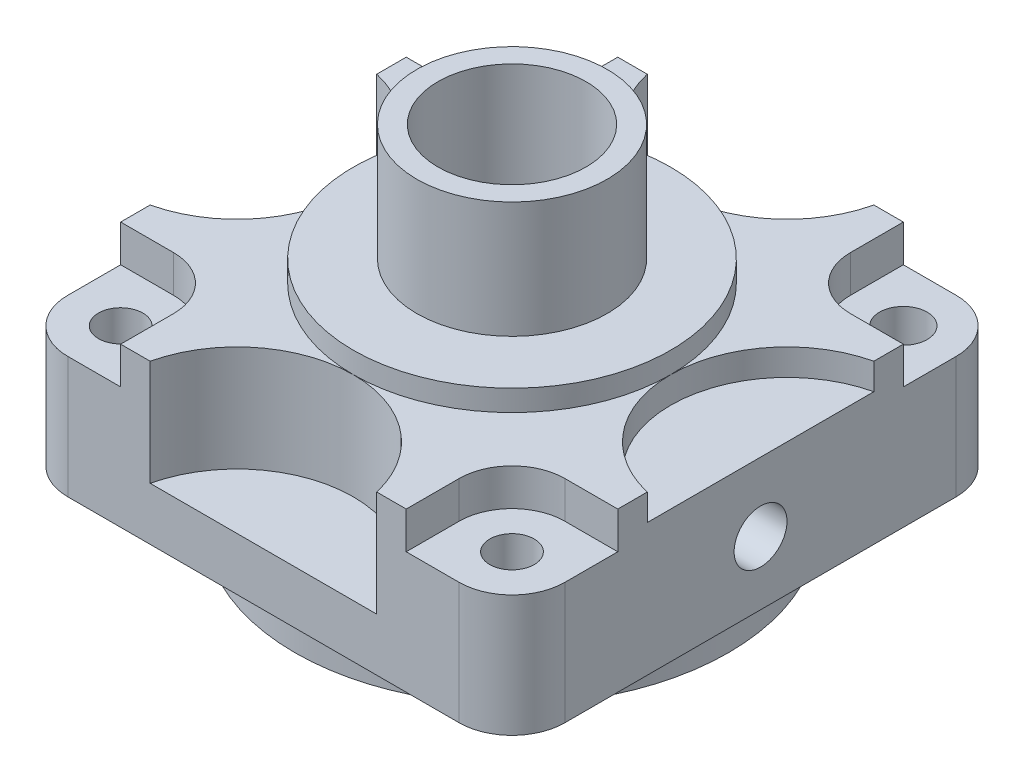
ISO-10303-21;
HEADER;
FILE_DESCRIPTION(('STEP AP214'),'2;1');
FILE_NAME('part.step','',(''),(''),'','','');
FILE_SCHEMA(('AUTOMOTIVE_DESIGN { 1 0 10303 214 1 1 1 1 }'));
ENDSEC;
DATA;
#1=APPLICATION_CONTEXT('core data for automotive mechanical design processes');
#2=APPLICATION_PROTOCOL_DEFINITION('international standard','automotive_design',2000,#1);
#3=PRODUCT_CONTEXT('',#1,'mechanical');
#4=PRODUCT('Part','Part','',(#3));
#5=PRODUCT_RELATED_PRODUCT_CATEGORY('part','',(#4));
#6=PRODUCT_DEFINITION_FORMATION('','',#4);
#7=PRODUCT_DEFINITION_CONTEXT('part definition',#1,'design');
#8=PRODUCT_DEFINITION('design','',#6,#7);
#9=PRODUCT_DEFINITION_SHAPE('','',#8);
#10=(LENGTH_UNIT() NAMED_UNIT(*) SI_UNIT(.MILLI.,.METRE.));
#11=(NAMED_UNIT(*) PLANE_ANGLE_UNIT() SI_UNIT($,.RADIAN.));
#12=(NAMED_UNIT(*) SI_UNIT($,.STERADIAN.) SOLID_ANGLE_UNIT());
#13=UNCERTAINTY_MEASURE_WITH_UNIT(LENGTH_MEASURE(1.E-05),#10,'distance_accuracy_value','');
#14=(GEOMETRIC_REPRESENTATION_CONTEXT(3) GLOBAL_UNCERTAINTY_ASSIGNED_CONTEXT((#13)) GLOBAL_UNIT_ASSIGNED_CONTEXT((#10,
#11,#12)) REPRESENTATION_CONTEXT('',''));
#15=CARTESIAN_POINT('',(0.,0.,0.));
#16=DIRECTION('',(0.,0.,1.));
#17=DIRECTION('',(1.,0.,0.));
#18=AXIS2_PLACEMENT_3D('',#15,#16,#17);
#19=CARTESIAN_POINT('',(-18.5,-8.5,42.));
#20=DIRECTION('',(0.,1.,0.));
#21=DIRECTION('',(0.,0.,1.));
#22=AXIS2_PLACEMENT_3D('',#19,#20,#21);
#23=CYLINDRICAL_SURFACE('',#22,2.09999999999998);
#24=CARTESIAN_POINT('',(-18.5,0.,42.));
#25=DIRECTION('',(0.,1.,0.));
#26=DIRECTION('',(0.,0.,1.));
#27=AXIS2_PLACEMENT_3D('',#24,#25,#26);
#28=CIRCLE('',#27,2.09999999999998);
#29=CARTESIAN_POINT('',(-18.5,0.,44.1));
#30=VERTEX_POINT('',#29);
#31=EDGE_CURVE('E554',#30,#30,#28,.T.);
#32=ORIENTED_EDGE('',*,*,#31,.F.);
#33=EDGE_LOOP('',(#32));
#34=FACE_BOUND('',#33,.T.);
#35=CARTESIAN_POINT('',(-18.5,11.5,42.));
#36=DIRECTION('',(0.,1.,0.));
#37=DIRECTION('',(0.,0.,1.));
#38=AXIS2_PLACEMENT_3D('',#35,#36,#37);
#39=CIRCLE('',#38,2.09999999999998);
#40=CARTESIAN_POINT('',(-18.5,11.5,44.1));
#41=VERTEX_POINT('',#40);
#42=EDGE_CURVE('E304',#41,#41,#39,.F.);
#43=ORIENTED_EDGE('',*,*,#42,.F.);
#44=EDGE_LOOP('',(#43));
#45=FACE_BOUND('',#44,.T.);
#46=ADVANCED_FACE('F36',(#34,#45),#23,.F.);
#47=CARTESIAN_POINT('',(-18.5,0.,42.));
#48=DIRECTION('',(0.,1.,0.));
#49=DIRECTION('',(-1.,0.,0.));
#50=AXIS2_PLACEMENT_3D('',#47,#48,#49);
#51=CYLINDRICAL_SURFACE('',#50,5.);
#52=DIRECTION('',(0.,-1.,0.));
#53=VECTOR('',#52,1.);
#54=CARTESIAN_POINT('',(-18.5,0.,47.));
#55=LINE('',#54,#53);
#56=CARTESIAN_POINT('',(-18.5,11.5,47.));
#57=VERTEX_POINT('',#56);
#58=CARTESIAN_POINT('',(-18.5,0.,47.));
#59=VERTEX_POINT('',#58);
#60=EDGE_CURVE('E561',#57,#59,#55,.T.);
#61=ORIENTED_EDGE('',*,*,#60,.F.);
#62=CARTESIAN_POINT('',(-18.5,11.5,42.));
#63=DIRECTION('',(0.,1.,0.));
#64=DIRECTION('',(0.,0.,1.));
#65=AXIS2_PLACEMENT_3D('',#62,#63,#64);
#66=CIRCLE('',#65,5.);
#67=CARTESIAN_POINT('',(-23.5,11.5,42.));
#68=VERTEX_POINT('',#67);
#69=EDGE_CURVE('E295',#68,#57,#66,.T.);
#70=ORIENTED_EDGE('',*,*,#69,.F.);
#71=DIRECTION('',(0.,-1.,0.));
#72=VECTOR('',#71,1.);
#73=CARTESIAN_POINT('',(-23.5,15.,42.));
#74=LINE('',#73,#72);
#75=CARTESIAN_POINT('',(-23.5,0.,42.));
#76=VERTEX_POINT('',#75);
#77=EDGE_CURVE('E573',#76,#68,#74,.F.);
#78=ORIENTED_EDGE('',*,*,#77,.F.);
#79=CARTESIAN_POINT('',(-18.5,0.,42.));
#80=DIRECTION('',(0.,1.,0.));
#81=DIRECTION('',(0.,0.,1.));
#82=AXIS2_PLACEMENT_3D('',#79,#80,#81);
#83=CIRCLE('',#82,5.);
#84=EDGE_CURVE('E569',#59,#76,#83,.F.);
#85=ORIENTED_EDGE('',*,*,#84,.F.);
#86=EDGE_LOOP('',(#61,#70,#78,#85));
#87=FACE_BOUND('',#86,.T.);
#88=ADVANCED_FACE('F653',(#87),#51,.T.);
#89=CARTESIAN_POINT('',(-18.5,-8.5,5.));
#90=DIRECTION('',(0.,1.,0.));
#91=DIRECTION('',(0.,0.,1.));
#92=AXIS2_PLACEMENT_3D('',#89,#90,#91);
#93=CYLINDRICAL_SURFACE('',#92,2.1);
#94=CARTESIAN_POINT('',(-18.5,0.,5.));
#95=DIRECTION('',(0.,1.,0.));
#96=DIRECTION('',(0.,0.,1.));
#97=AXIS2_PLACEMENT_3D('',#94,#95,#96);
#98=CIRCLE('',#97,2.1);
#99=CARTESIAN_POINT('',(-18.5,0.,7.09999999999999));
#100=VERTEX_POINT('',#99);
#101=EDGE_CURVE('E413',#100,#100,#98,.T.);
#102=ORIENTED_EDGE('',*,*,#101,.F.);
#103=EDGE_LOOP('',(#102));
#104=FACE_BOUND('',#103,.T.);
#105=CARTESIAN_POINT('',(-18.5,11.5,5.));
#106=DIRECTION('',(0.,1.,0.));
#107=DIRECTION('',(0.,0.,1.));
#108=AXIS2_PLACEMENT_3D('',#105,#106,#107);
#109=CIRCLE('',#108,2.1);
#110=CARTESIAN_POINT('',(-18.5,11.5,7.09999999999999));
#111=VERTEX_POINT('',#110);
#112=EDGE_CURVE('E334',#111,#111,#109,.F.);
#113=ORIENTED_EDGE('',*,*,#112,.F.);
#114=EDGE_LOOP('',(#113));
#115=FACE_BOUND('',#114,.T.);
#116=ADVANCED_FACE('F659',(#104,#115),#93,.F.);
#117=CARTESIAN_POINT('',(-18.5,15.,5.));
#118=DIRECTION('',(0.,-1.,0.));
#119=DIRECTION('',(1.,0.,0.));
#120=AXIS2_PLACEMENT_3D('',#117,#118,#119);
#121=CYLINDRICAL_SURFACE('',#120,5.);
#122=DIRECTION('',(0.,-1.,0.));
#123=VECTOR('',#122,1.);
#124=CARTESIAN_POINT('',(-23.5,15.,5.));
#125=LINE('',#124,#123);
#126=CARTESIAN_POINT('',(-23.5,11.5,5.));
#127=VERTEX_POINT('',#126);
#128=CARTESIAN_POINT('',(-23.5,0.,5.));
#129=VERTEX_POINT('',#128);
#130=EDGE_CURVE('E571',#127,#129,#125,.T.);
#131=ORIENTED_EDGE('',*,*,#130,.F.);
#132=CARTESIAN_POINT('',(-18.5,11.5,5.));
#133=DIRECTION('',(0.,1.,0.));
#134=DIRECTION('',(0.,0.,1.));
#135=AXIS2_PLACEMENT_3D('',#132,#133,#134);
#136=CIRCLE('',#135,5.);
#137=CARTESIAN_POINT('',(-18.5,11.5,0.));
#138=VERTEX_POINT('',#137);
#139=EDGE_CURVE('E318',#138,#127,#136,.T.);
#140=ORIENTED_EDGE('',*,*,#139,.F.);
#141=DIRECTION('',(0.,-1.,0.));
#142=VECTOR('',#141,1.);
#143=CARTESIAN_POINT('',(-18.5,0.,0.));
#144=LINE('',#143,#142);
#145=CARTESIAN_POINT('',(-18.5,0.,0.));
#146=VERTEX_POINT('',#145);
#147=EDGE_CURVE('E578',#146,#138,#144,.F.);
#148=ORIENTED_EDGE('',*,*,#147,.F.);
#149=CARTESIAN_POINT('',(-18.5,0.,5.));
#150=DIRECTION('',(0.,1.,0.));
#151=DIRECTION('',(0.,0.,1.));
#152=AXIS2_PLACEMENT_3D('',#149,#150,#151);
#153=CIRCLE('',#152,5.);
#154=EDGE_CURVE('E567',#129,#146,#153,.F.);
#155=ORIENTED_EDGE('',*,*,#154,.F.);
#156=EDGE_LOOP('',(#131,#140,#148,#155));
#157=FACE_BOUND('',#156,.T.);
#158=ADVANCED_FACE('F673',(#157),#121,.T.);
#159=CARTESIAN_POINT('',(18.5,-8.5,5.));
#160=DIRECTION('',(0.,1.,0.));
#161=DIRECTION('',(0.,0.,1.));
#162=AXIS2_PLACEMENT_3D('',#159,#160,#161);
#163=CYLINDRICAL_SURFACE('',#162,2.25);
#164=CARTESIAN_POINT('',(18.5,0.,5.));
#165=DIRECTION('',(0.,1.,0.));
#166=DIRECTION('',(0.,0.,1.));
#167=AXIS2_PLACEMENT_3D('',#164,#165,#166);
#168=CIRCLE('',#167,2.25);
#169=CARTESIAN_POINT('',(18.5,0.,7.25));
#170=VERTEX_POINT('',#169);
#171=EDGE_CURVE('E548',#170,#170,#168,.T.);
#172=ORIENTED_EDGE('',*,*,#171,.F.);
#173=EDGE_LOOP('',(#172));
#174=FACE_BOUND('',#173,.T.);
#175=CARTESIAN_POINT('',(18.5,11.5,5.));
#176=DIRECTION('',(0.,1.,0.));
#177=DIRECTION('',(0.,0.,1.));
#178=AXIS2_PLACEMENT_3D('',#175,#176,#177);
#179=CIRCLE('',#178,2.25);
#180=CARTESIAN_POINT('',(18.5,11.5,7.25));
#181=VERTEX_POINT('',#180);
#182=EDGE_CURVE('E369',#181,#181,#179,.F.);
#183=ORIENTED_EDGE('',*,*,#182,.F.);
#184=EDGE_LOOP('',(#183));
#185=FACE_BOUND('',#184,.T.);
#186=ADVANCED_FACE('F671',(#174,#185),#163,.F.);
#187=CARTESIAN_POINT('',(18.5,15.,5.));
#188=DIRECTION('',(0.,1.,0.));
#189=DIRECTION('',(-1.,0.,0.));
#190=AXIS2_PLACEMENT_3D('',#187,#188,#189);
#191=CYLINDRICAL_SURFACE('',#190,5.);
#192=DIRECTION('',(0.,1.,0.));
#193=VECTOR('',#192,1.);
#194=CARTESIAN_POINT('',(18.5,0.,0.));
#195=LINE('',#194,#193);
#196=CARTESIAN_POINT('',(18.5,11.5,0.));
#197=VERTEX_POINT('',#196);
#198=CARTESIAN_POINT('',(18.5,0.,0.));
#199=VERTEX_POINT('',#198);
#200=EDGE_CURVE('E576',#197,#199,#195,.F.);
#201=ORIENTED_EDGE('',*,*,#200,.F.);
#202=CARTESIAN_POINT('',(18.5,11.5,5.));
#203=DIRECTION('',(0.,1.,0.));
#204=DIRECTION('',(0.,0.,1.));
#205=AXIS2_PLACEMENT_3D('',#202,#203,#204);
#206=CIRCLE('',#205,5.);
#207=CARTESIAN_POINT('',(23.5,11.5,5.));
#208=VERTEX_POINT('',#207);
#209=EDGE_CURVE('E353',#208,#197,#206,.T.);
#210=ORIENTED_EDGE('',*,*,#209,.F.);
#211=DIRECTION('',(0.,1.,0.));
#212=VECTOR('',#211,1.);
#213=CARTESIAN_POINT('',(23.5,15.,5.));
#214=LINE('',#213,#212);
#215=CARTESIAN_POINT('',(23.5,0.,5.));
#216=VERTEX_POINT('',#215);
#217=EDGE_CURVE('E49',#216,#208,#214,.T.);
#218=ORIENTED_EDGE('',*,*,#217,.F.);
#219=CARTESIAN_POINT('',(18.5,0.,5.));
#220=DIRECTION('',(0.,1.,0.));
#221=DIRECTION('',(0.,0.,1.));
#222=AXIS2_PLACEMENT_3D('',#219,#220,#221);
#223=CIRCLE('',#222,5.);
#224=EDGE_CURVE('E563',#199,#216,#223,.F.);
#225=ORIENTED_EDGE('',*,*,#224,.F.);
#226=EDGE_LOOP('',(#201,#210,#218,#225));
#227=FACE_BOUND('',#226,.T.);
#228=ADVANCED_FACE('F38',(#227),#191,.T.);
#229=CARTESIAN_POINT('',(18.5,-8.5,42.));
#230=DIRECTION('',(0.,1.,0.));
#231=DIRECTION('',(0.,0.,1.));
#232=AXIS2_PLACEMENT_3D('',#229,#230,#231);
#233=CYLINDRICAL_SURFACE('',#232,2.09999999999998);
#234=CARTESIAN_POINT('',(18.5,0.,42.));
#235=DIRECTION('',(0.,1.,0.));
#236=DIRECTION('',(0.,0.,1.));
#237=AXIS2_PLACEMENT_3D('',#234,#235,#236);
#238=CIRCLE('',#237,2.09999999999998);
#239=CARTESIAN_POINT('',(18.5,0.,44.1));
#240=VERTEX_POINT('',#239);
#241=EDGE_CURVE('E551',#240,#240,#238,.T.);
#242=ORIENTED_EDGE('',*,*,#241,.F.);
#243=EDGE_LOOP('',(#242));
#244=FACE_BOUND('',#243,.T.);
#245=CARTESIAN_POINT('',(18.5,11.5,42.));
#246=DIRECTION('',(0.,1.,0.));
#247=DIRECTION('',(0.,0.,1.));
#248=AXIS2_PLACEMENT_3D('',#245,#246,#247);
#249=CIRCLE('',#248,2.09999999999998);
#250=CARTESIAN_POINT('',(18.5,11.5,44.1));
#251=VERTEX_POINT('',#250);
#252=EDGE_CURVE('E404',#251,#251,#249,.F.);
#253=ORIENTED_EDGE('',*,*,#252,.F.);
#254=EDGE_LOOP('',(#253));
#255=FACE_BOUND('',#254,.T.);
#256=ADVANCED_FACE('F667',(#244,#255),#233,.F.);
#257=CARTESIAN_POINT('',(18.5,0.,42.));
#258=DIRECTION('',(0.,-1.,0.));
#259=DIRECTION('',(1.,0.,0.));
#260=AXIS2_PLACEMENT_3D('',#257,#258,#259);
#261=CYLINDRICAL_SURFACE('',#260,5.);
#262=DIRECTION('',(0.,1.,0.));
#263=VECTOR('',#262,1.);
#264=CARTESIAN_POINT('',(23.5,0.,42.));
#265=LINE('',#264,#263);
#266=CARTESIAN_POINT('',(23.5,11.5,42.));
#267=VERTEX_POINT('',#266);
#268=CARTESIAN_POINT('',(23.5,0.,42.));
#269=VERTEX_POINT('',#268);
#270=EDGE_CURVE('E11',#267,#269,#265,.F.);
#271=ORIENTED_EDGE('',*,*,#270,.F.);
#272=CARTESIAN_POINT('',(18.5,11.5,42.));
#273=DIRECTION('',(0.,1.,0.));
#274=DIRECTION('',(0.,0.,1.));
#275=AXIS2_PLACEMENT_3D('',#272,#273,#274);
#276=CIRCLE('',#275,5.);
#277=CARTESIAN_POINT('',(18.5,11.5,47.));
#278=VERTEX_POINT('',#277);
#279=EDGE_CURVE('E388',#278,#267,#276,.T.);
#280=ORIENTED_EDGE('',*,*,#279,.F.);
#281=DIRECTION('',(0.,1.,0.));
#282=VECTOR('',#281,1.);
#283=CARTESIAN_POINT('',(18.5,15.,47.));
#284=LINE('',#283,#282);
#285=CARTESIAN_POINT('',(18.5,0.,47.));
#286=VERTEX_POINT('',#285);
#287=EDGE_CURVE('E543',#286,#278,#284,.T.);
#288=ORIENTED_EDGE('',*,*,#287,.F.);
#289=CARTESIAN_POINT('',(18.5,0.,42.));
#290=DIRECTION('',(0.,1.,0.));
#291=DIRECTION('',(0.,0.,1.));
#292=AXIS2_PLACEMENT_3D('',#289,#290,#291);
#293=CIRCLE('',#292,5.);
#294=EDGE_CURVE('E565',#269,#286,#293,.F.);
#295=ORIENTED_EDGE('',*,*,#294,.F.);
#296=EDGE_LOOP('',(#271,#280,#288,#295));
#297=FACE_BOUND('',#296,.T.);
#298=ADVANCED_FACE('F669',(#297),#261,.T.);
#299=CARTESIAN_POINT('',(-23.5,15.,47.));
#300=DIRECTION('',(0.,-1.,0.));
#301=DIRECTION('',(0.,0.,-1.));
#302=AXIS2_PLACEMENT_3D('',#299,#300,#301);
#303=PLANE('',#302);
#304=CARTESIAN_POINT('',(18.5,15.,42.));
#305=DIRECTION('',(0.,1.,0.));
#306=DIRECTION('',(0.,0.,1.));
#307=AXIS2_PLACEMENT_3D('',#304,#305,#306);
#308=CIRCLE('',#307,5.);
#309=CARTESIAN_POINT('',(18.5,15.,37.));
#310=VERTEX_POINT('',#309);
#311=CARTESIAN_POINT('',(13.5,15.,42.));
#312=VERTEX_POINT('',#311);
#313=EDGE_CURVE('E378',#310,#312,#308,.T.);
#314=ORIENTED_EDGE('',*,*,#313,.F.);
#315=DIRECTION('',(-1.,0.,0.));
#316=VECTOR('',#315,1.);
#317=CARTESIAN_POINT('',(18.5,15.,37.));
#318=LINE('',#317,#316);
#319=CARTESIAN_POINT('',(23.5,15.,37.));
#320=VERTEX_POINT('',#319);
#321=EDGE_CURVE('E383',#320,#310,#318,.T.);
#322=ORIENTED_EDGE('',*,*,#321,.F.);
#323=DIRECTION('',(0.,0.,-1.));
#324=VECTOR('',#323,1.);
#325=CARTESIAN_POINT('',(23.5,15.,47.));
#326=LINE('',#325,#324);
#327=CARTESIAN_POINT('',(23.5,15.,34.2121426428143));
#328=VERTEX_POINT('',#327);
#329=EDGE_CURVE('E527',#320,#328,#326,.T.);
#330=ORIENTED_EDGE('',*,*,#329,.T.);
#331=CARTESIAN_POINT('',(26.,15.,23.5));
#332=DIRECTION('',(0.,1.,0.));
#333=DIRECTION('',(0.,0.,1.));
#334=AXIS2_PLACEMENT_3D('',#331,#332,#333);
#335=CIRCLE('',#334,11.);
#336=CARTESIAN_POINT('',(15.,15.,23.5));
#337=VERTEX_POINT('',#336);
#338=EDGE_CURVE('E422',#337,#328,#335,.T.);
#339=ORIENTED_EDGE('',*,*,#338,.F.);
#340=CARTESIAN_POINT('',(0.,15.,23.5));
#341=DIRECTION('',(0.,-1.,0.));
#342=DIRECTION('',(0.,0.,-1.));
#343=AXIS2_PLACEMENT_3D('',#340,#341,#342);
#344=CIRCLE('',#343,15.);
#345=CARTESIAN_POINT('',(0.,15.,38.5));
#346=VERTEX_POINT('',#345);
#347=EDGE_CURVE('E545',#346,#337,#344,.F.);
#348=ORIENTED_EDGE('',*,*,#347,.F.);
#349=CARTESIAN_POINT('',(0.,15.,49.5));
#350=DIRECTION('',(0.,1.,0.));
#351=DIRECTION('',(0.,0.,1.));
#352=AXIS2_PLACEMENT_3D('',#349,#350,#351);
#353=CIRCLE('',#352,11.);
#354=CARTESIAN_POINT('',(10.7121426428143,15.,47.));
#355=VERTEX_POINT('',#354);
#356=EDGE_CURVE('E451',#355,#346,#353,.T.);
#357=ORIENTED_EDGE('',*,*,#356,.F.);
#358=DIRECTION('',(-1.,0.,0.));
#359=VECTOR('',#358,1.);
#360=CARTESIAN_POINT('',(-23.5,15.,47.));
#361=LINE('',#360,#359);
#362=CARTESIAN_POINT('',(13.5,15.,47.));
#363=VERTEX_POINT('',#362);
#364=EDGE_CURVE('E516',#363,#355,#361,.T.);
#365=ORIENTED_EDGE('',*,*,#364,.F.);
#366=DIRECTION('',(0.,0.,1.));
#367=VECTOR('',#366,1.);
#368=CARTESIAN_POINT('',(13.5,15.,42.));
#369=LINE('',#368,#367);
#370=EDGE_CURVE('E398',#312,#363,#369,.T.);
#371=ORIENTED_EDGE('',*,*,#370,.F.);
#372=EDGE_LOOP('',(#314,#322,#330,#339,#348,#357,#365,#371));
#373=FACE_BOUND('',#372,.T.);
#374=ADVANCED_FACE('F630',(#373),#303,.F.);
#375=CARTESIAN_POINT('',(-18.5,15.,5.));
#376=DIRECTION('',(0.,1.,0.));
#377=DIRECTION('',(0.,0.,1.));
#378=AXIS2_PLACEMENT_3D('',#375,#376,#377);
#379=CIRCLE('',#378,5.);
#380=CARTESIAN_POINT('',(-18.5,15.,9.99999999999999));
#381=VERTEX_POINT('',#380);
#382=CARTESIAN_POINT('',(-13.5,15.,5.));
#383=VERTEX_POINT('',#382);
#384=EDGE_CURVE('E310',#381,#383,#379,.T.);
#385=ORIENTED_EDGE('',*,*,#384,.F.);
#386=DIRECTION('',(1.,0.,0.));
#387=VECTOR('',#386,1.);
#388=CARTESIAN_POINT('',(-18.5,15.,9.99999999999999));
#389=LINE('',#388,#387);
#390=CARTESIAN_POINT('',(-23.5,15.,9.99999999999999));
#391=VERTEX_POINT('',#390);
#392=EDGE_CURVE('E315',#391,#381,#389,.T.);
#393=ORIENTED_EDGE('',*,*,#392,.F.);
#394=DIRECTION('',(0.,0.,-1.));
#395=VECTOR('',#394,1.);
#396=CARTESIAN_POINT('',(-23.5,15.,47.));
#397=LINE('',#396,#395);
#398=CARTESIAN_POINT('',(-23.5,15.,12.7878573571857));
#399=VERTEX_POINT('',#398);
#400=EDGE_CURVE('E518',#399,#391,#397,.T.);
#401=ORIENTED_EDGE('',*,*,#400,.F.);
#402=CARTESIAN_POINT('',(-26.,15.,23.5));
#403=DIRECTION('',(0.,1.,0.));
#404=DIRECTION('',(0.,0.,1.));
#405=AXIS2_PLACEMENT_3D('',#402,#403,#404);
#406=CIRCLE('',#405,11.);
#407=CARTESIAN_POINT('',(-15.,15.,23.5));
#408=VERTEX_POINT('',#407);
#409=EDGE_CURVE('E433',#408,#399,#406,.T.);
#410=ORIENTED_EDGE('',*,*,#409,.F.);
#411=CARTESIAN_POINT('',(0.,15.,8.5));
#412=VERTEX_POINT('',#411);
#413=EDGE_CURVE('E540',#412,#408,#344,.F.);
#414=ORIENTED_EDGE('',*,*,#413,.F.);
#415=CARTESIAN_POINT('',(0.,15.,-2.5));
#416=DIRECTION('',(0.,1.,0.));
#417=DIRECTION('',(0.,0.,1.));
#418=AXIS2_PLACEMENT_3D('',#415,#416,#417);
#419=CIRCLE('',#418,11.);
#420=CARTESIAN_POINT('',(-10.7121426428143,15.,0.));
#421=VERTEX_POINT('',#420);
#422=EDGE_CURVE('E466',#421,#412,#419,.T.);
#423=ORIENTED_EDGE('',*,*,#422,.F.);
#424=DIRECTION('',(-1.,0.,0.));
#425=VECTOR('',#424,1.);
#426=CARTESIAN_POINT('',(-23.5,15.,0.));
#427=LINE('',#426,#425);
#428=CARTESIAN_POINT('',(-13.5,15.,0.));
#429=VERTEX_POINT('',#428);
#430=EDGE_CURVE('E522',#421,#429,#427,.T.);
#431=ORIENTED_EDGE('',*,*,#430,.T.);
#432=DIRECTION('',(0.,0.,-1.));
#433=VECTOR('',#432,1.);
#434=CARTESIAN_POINT('',(-13.5,15.,5.));
#435=LINE('',#434,#433);
#436=EDGE_CURVE('E328',#383,#429,#435,.T.);
#437=ORIENTED_EDGE('',*,*,#436,.F.);
#438=EDGE_LOOP('',(#385,#393,#401,#410,#414,#423,#431,#437));
#439=FACE_BOUND('',#438,.T.);
#440=ADVANCED_FACE('F746',(#439),#303,.F.);
#441=CARTESIAN_POINT('',(18.5,15.,5.));
#442=DIRECTION('',(0.,1.,0.));
#443=DIRECTION('',(0.,0.,1.));
#444=AXIS2_PLACEMENT_3D('',#441,#442,#443);
#445=CIRCLE('',#444,4.99999999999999);
#446=CARTESIAN_POINT('',(13.5,15.,5.));
#447=VERTEX_POINT('',#446);
#448=CARTESIAN_POINT('',(18.5,15.,9.99999999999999));
#449=VERTEX_POINT('',#448);
#450=EDGE_CURVE('E343',#447,#449,#445,.T.);
#451=ORIENTED_EDGE('',*,*,#450,.F.);
#452=DIRECTION('',(0.,0.,1.));
#453=VECTOR('',#452,1.);
#454=CARTESIAN_POINT('',(13.5,15.,5.));
#455=LINE('',#454,#453);
#456=CARTESIAN_POINT('',(13.5,15.,0.));
#457=VERTEX_POINT('',#456);
#458=EDGE_CURVE('E348',#457,#447,#455,.T.);
#459=ORIENTED_EDGE('',*,*,#458,.F.);
#460=CARTESIAN_POINT('',(10.7121426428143,15.,0.));
#461=VERTEX_POINT('',#460);
#462=EDGE_CURVE('E515',#457,#461,#427,.T.);
#463=ORIENTED_EDGE('',*,*,#462,.T.);
#464=EDGE_CURVE('E460',#412,#461,#419,.T.);
#465=ORIENTED_EDGE('',*,*,#464,.F.);
#466=EDGE_CURVE('E539',#337,#412,#344,.F.);
#467=ORIENTED_EDGE('',*,*,#466,.F.);
#468=CARTESIAN_POINT('',(23.5,15.,12.7878573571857));
#469=VERTEX_POINT('',#468);
#470=EDGE_CURVE('E417',#469,#337,#335,.T.);
#471=ORIENTED_EDGE('',*,*,#470,.F.);
#472=CARTESIAN_POINT('',(23.5,15.,9.99999999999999));
#473=VERTEX_POINT('',#472);
#474=EDGE_CURVE('E526',#469,#473,#326,.T.);
#475=ORIENTED_EDGE('',*,*,#474,.T.);
#476=DIRECTION('',(1.,0.,0.));
#477=VECTOR('',#476,1.);
#478=CARTESIAN_POINT('',(18.5,15.,9.99999999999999));
#479=LINE('',#478,#477);
#480=EDGE_CURVE('E363',#449,#473,#479,.T.);
#481=ORIENTED_EDGE('',*,*,#480,.F.);
#482=EDGE_LOOP('',(#451,#459,#463,#465,#467,#471,#475,#481));
#483=FACE_BOUND('',#482,.T.);
#484=ADVANCED_FACE('F606',(#483),#303,.F.);
#485=CARTESIAN_POINT('',(0.,-8.5,23.5));
#486=DIRECTION('',(0.,1.,0.));
#487=DIRECTION('',(0.,0.,1.));
#488=AXIS2_PLACEMENT_3D('',#485,#486,#487);
#489=CYLINDRICAL_SURFACE('',#488,5.75);
#490=CARTESIAN_POINT('',(0.,15.,23.5));
#491=DIRECTION('',(0.,1.,0.));
#492=DIRECTION('',(0.,0.,1.));
#493=AXIS2_PLACEMENT_3D('',#490,#491,#492);
#494=CIRCLE('',#493,5.75);
#495=CARTESIAN_POINT('',(0.,15.,29.25));
#496=VERTEX_POINT('',#495);
#497=EDGE_CURVE('E483',#496,#496,#494,.T.);
#498=ORIENTED_EDGE('',*,*,#497,.T.);
#499=EDGE_LOOP('',(#498));
#500=FACE_BOUND('',#499,.T.);
#501=CARTESIAN_POINT('',(0.,8.5,23.5));
#502=DIRECTION('',(0.,-1.,0.));
#503=DIRECTION('',(1.,0.,0.));
#504=AXIS2_PLACEMENT_3D('',#501,#502,#503);
#505=CIRCLE('',#504,5.75);
#506=CARTESIAN_POINT('',(5.75,8.5,23.5));
#507=VERTEX_POINT('',#506);
#508=EDGE_CURVE('E480',#507,#507,#505,.F.);
#509=ORIENTED_EDGE('',*,*,#508,.F.);
#510=EDGE_LOOP('',(#509));
#511=FACE_BOUND('',#510,.T.);
#512=ADVANCED_FACE('F786',(#500,#511),#489,.F.);
#513=CARTESIAN_POINT('',(0.,17.,23.5));
#514=DIRECTION('',(0.,1.,0.));
#515=DIRECTION('',(0.,0.,1.));
#516=AXIS2_PLACEMENT_3D('',#513,#514,#515);
#517=PLANE('',#516);
#518=CARTESIAN_POINT('',(0.,17.,23.5));
#519=DIRECTION('',(0.,1.,0.));
#520=DIRECTION('',(0.,0.,1.));
#521=AXIS2_PLACEMENT_3D('',#518,#519,#520);
#522=CIRCLE('',#521,15.);
#523=CARTESIAN_POINT('',(0.,17.,38.5));
#524=VERTEX_POINT('',#523);
#525=EDGE_CURVE('E496',#524,#524,#522,.T.);
#526=ORIENTED_EDGE('',*,*,#525,.T.);
#527=EDGE_LOOP('',(#526));
#528=FACE_BOUND('',#527,.T.);
#529=CARTESIAN_POINT('',(0.,17.,23.5));
#530=DIRECTION('',(0.,1.,0.));
#531=DIRECTION('',(0.,0.,1.));
#532=AXIS2_PLACEMENT_3D('',#529,#530,#531);
#533=CIRCLE('',#532,8.99999999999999);
#534=CARTESIAN_POINT('',(0.,17.,32.5));
#535=VERTEX_POINT('',#534);
#536=EDGE_CURVE('E490',#535,#535,#533,.T.);
#537=ORIENTED_EDGE('',*,*,#536,.F.);
#538=EDGE_LOOP('',(#537));
#539=FACE_BOUND('',#538,.T.);
#540=ADVANCED_FACE('F789',(#528,#539),#517,.T.);
#541=CARTESIAN_POINT('',(-18.5,15.,42.));
#542=DIRECTION('',(0.,1.,0.));
#543=DIRECTION('',(0.,0.,1.));
#544=AXIS2_PLACEMENT_3D('',#541,#542,#543);
#545=CIRCLE('',#544,5.);
#546=CARTESIAN_POINT('',(-13.5,15.,42.));
#547=VERTEX_POINT('',#546);
#548=CARTESIAN_POINT('',(-18.5,15.,37.));
#549=VERTEX_POINT('',#548);
#550=EDGE_CURVE('E273',#547,#549,#545,.T.);
#551=ORIENTED_EDGE('',*,*,#550,.F.);
#552=DIRECTION('',(0.,0.,-1.));
#553=VECTOR('',#552,1.);
#554=CARTESIAN_POINT('',(-13.5,15.,42.));
#555=LINE('',#554,#553);
#556=CARTESIAN_POINT('',(-13.5,15.,47.));
#557=VERTEX_POINT('',#556);
#558=EDGE_CURVE('E286',#557,#547,#555,.T.);
#559=ORIENTED_EDGE('',*,*,#558,.F.);
#560=CARTESIAN_POINT('',(-10.7121426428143,15.,47.));
#561=VERTEX_POINT('',#560);
#562=EDGE_CURVE('E514',#561,#557,#361,.T.);
#563=ORIENTED_EDGE('',*,*,#562,.F.);
#564=EDGE_CURVE('E445',#346,#561,#353,.T.);
#565=ORIENTED_EDGE('',*,*,#564,.F.);
#566=EDGE_CURVE('E544',#408,#346,#344,.F.);
#567=ORIENTED_EDGE('',*,*,#566,.F.);
#568=CARTESIAN_POINT('',(-23.5,15.,34.2121426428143));
#569=VERTEX_POINT('',#568);
#570=EDGE_CURVE('E437',#569,#408,#406,.T.);
#571=ORIENTED_EDGE('',*,*,#570,.F.);
#572=CARTESIAN_POINT('',(-23.5,15.,37.));
#573=VERTEX_POINT('',#572);
#574=EDGE_CURVE('E524',#573,#569,#397,.T.);
#575=ORIENTED_EDGE('',*,*,#574,.F.);
#576=DIRECTION('',(-1.,0.,0.));
#577=VECTOR('',#576,1.);
#578=CARTESIAN_POINT('',(-18.5,15.,37.));
#579=LINE('',#578,#577);
#580=EDGE_CURVE('E289',#549,#573,#579,.T.);
#581=ORIENTED_EDGE('',*,*,#580,.F.);
#582=EDGE_LOOP('',(#551,#559,#563,#565,#567,#571,#575,#581));
#583=FACE_BOUND('',#582,.T.);
#584=ADVANCED_FACE('F809',(#583),#303,.F.);
#585=CARTESIAN_POINT('',(0.,-5.,23.5284931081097));
#586=DIRECTION('',(0.,-1.,0.));
#587=DIRECTION('',(1.,0.,0.));
#588=AXIS2_PLACEMENT_3D('',#585,#586,#587);
#589=PLANE('',#588);
#590=CARTESIAN_POINT('',(16.,-5.,23.5));
#591=DIRECTION('',(0.,-1.,0.));
#592=DIRECTION('',(1.,0.,0.));
#593=AXIS2_PLACEMENT_3D('',#590,#591,#592);
#594=CIRCLE('',#593,2.00000000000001);
#595=CARTESIAN_POINT('',(18.,-5.,23.5));
#596=VERTEX_POINT('',#595);
#597=EDGE_CURVE('E292',#596,#596,#594,.T.);
#598=ORIENTED_EDGE('',*,*,#597,.F.);
#599=EDGE_LOOP('',(#598));
#600=FACE_BOUND('',#599,.T.);
#601=CARTESIAN_POINT('',(0.,-5.,23.5284931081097));
#602=DIRECTION('',(0.,-1.,0.));
#603=DIRECTION('',(1.,0.,0.));
#604=AXIS2_PLACEMENT_3D('',#601,#602,#603);
#605=CIRCLE('',#604,20.5);
#606=CARTESIAN_POINT('',(20.5,-5.,23.5284931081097));
#607=VERTEX_POINT('',#606);
#608=EDGE_CURVE('E505',#607,#607,#605,.T.);
#609=ORIENTED_EDGE('',*,*,#608,.T.);
#610=EDGE_LOOP('',(#609));
#611=FACE_BOUND('',#610,.T.);
#612=CARTESIAN_POINT('',(0.,-5.,23.5284931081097));
#613=DIRECTION('',(0.,-1.,0.));
#614=DIRECTION('',(1.,0.,0.));
#615=AXIS2_PLACEMENT_3D('',#612,#613,#614);
#616=CIRCLE('',#615,9.75);
#617=CARTESIAN_POINT('',(9.75,-5.,23.5284931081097));
#618=VERTEX_POINT('',#617);
#619=EDGE_CURVE('E501',#618,#618,#616,.T.);
#620=ORIENTED_EDGE('',*,*,#619,.F.);
#621=EDGE_LOOP('',(#620));
#622=FACE_BOUND('',#621,.T.);
#623=ADVANCED_FACE('F823',(#600,#611,#622),#589,.T.);
#624=CARTESIAN_POINT('',(-23.5,0.,47.));
#625=DIRECTION('',(0.,1.,0.));
#626=DIRECTION('',(0.,0.,1.));
#627=AXIS2_PLACEMENT_3D('',#624,#625,#626);
#628=PLANE('',#627);
#629=ORIENTED_EDGE('',*,*,#101,.T.);
#630=EDGE_LOOP('',(#629));
#631=FACE_BOUND('',#630,.T.);
#632=ORIENTED_EDGE('',*,*,#31,.T.);
#633=EDGE_LOOP('',(#632));
#634=FACE_BOUND('',#633,.T.);
#635=ORIENTED_EDGE('',*,*,#241,.T.);
#636=EDGE_LOOP('',(#635));
#637=FACE_BOUND('',#636,.T.);
#638=ORIENTED_EDGE('',*,*,#171,.T.);
#639=EDGE_LOOP('',(#638));
#640=FACE_BOUND('',#639,.T.);
#641=DIRECTION('',(1.,0.,0.));
#642=VECTOR('',#641,1.);
#643=CARTESIAN_POINT('',(-23.5,0.,47.));
#644=LINE('',#643,#642);
#645=EDGE_CURVE('E511',#59,#286,#644,.T.);
#646=ORIENTED_EDGE('',*,*,#645,.F.);
#647=ORIENTED_EDGE('',*,*,#84,.T.);
#648=DIRECTION('',(0.,0.,-1.));
#649=VECTOR('',#648,1.);
#650=CARTESIAN_POINT('',(-23.5,0.,47.));
#651=LINE('',#650,#649);
#652=EDGE_CURVE('E533',#76,#129,#651,.T.);
#653=ORIENTED_EDGE('',*,*,#652,.T.);
#654=ORIENTED_EDGE('',*,*,#154,.T.);
#655=DIRECTION('',(1.,0.,0.));
#656=VECTOR('',#655,1.);
#657=CARTESIAN_POINT('',(-23.5,0.,0.));
#658=LINE('',#657,#656);
#659=EDGE_CURVE('E510',#146,#199,#658,.T.);
#660=ORIENTED_EDGE('',*,*,#659,.T.);
#661=ORIENTED_EDGE('',*,*,#224,.T.);
#662=DIRECTION('',(0.,0.,-1.));
#663=VECTOR('',#662,1.);
#664=CARTESIAN_POINT('',(23.5,0.,47.));
#665=LINE('',#664,#663);
#666=EDGE_CURVE('E529',#269,#216,#665,.T.);
#667=ORIENTED_EDGE('',*,*,#666,.F.);
#668=ORIENTED_EDGE('',*,*,#294,.T.);
#669=EDGE_LOOP('',(#646,#647,#653,#654,#660,#661,#667,#668));
#670=FACE_BOUND('',#669,.T.);
#671=CARTESIAN_POINT('',(0.,0.,23.5284931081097));
#672=DIRECTION('',(0.,1.,0.));
#673=DIRECTION('',(0.,0.,1.));
#674=AXIS2_PLACEMENT_3D('',#671,#672,#673);
#675=CIRCLE('',#674,20.5);
#676=CARTESIAN_POINT('',(0.,0.,44.0284931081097));
#677=VERTEX_POINT('',#676);
#678=EDGE_CURVE('E536',#677,#677,#675,.F.);
#679=ORIENTED_EDGE('',*,*,#678,.F.);
#680=EDGE_LOOP('',(#679));
#681=FACE_BOUND('',#680,.T.);
#682=ADVANCED_FACE('F727',(#631,#634,#637,#640,#670,#681),#628,.F.);
#683=CARTESIAN_POINT('',(-23.5,15.,47.));
#684=DIRECTION('',(1.,0.,0.));
#685=DIRECTION('',(0.,1.,0.));
#686=AXIS2_PLACEMENT_3D('',#683,#684,#685);
#687=PLANE('',#686);
#688=DIRECTION('',(0.,0.,1.));
#689=VECTOR('',#688,1.);
#690=CARTESIAN_POINT('',(-23.5,11.5,37.));
#691=LINE('',#690,#689);
#692=CARTESIAN_POINT('',(-23.5,11.5,37.));
#693=VERTEX_POINT('',#692);
#694=EDGE_CURVE('E56',#693,#68,#691,.T.);
#695=ORIENTED_EDGE('',*,*,#694,.F.);
#696=DIRECTION('',(0.,1.,0.));
#697=VECTOR('',#696,1.);
#698=CARTESIAN_POINT('',(-23.5,11.5,37.));
#699=LINE('',#698,#697);
#700=EDGE_CURVE('E276',#693,#573,#699,.T.);
#701=ORIENTED_EDGE('',*,*,#700,.T.);
#702=ORIENTED_EDGE('',*,*,#574,.T.);
#703=DIRECTION('',(0.,1.,0.));
#704=VECTOR('',#703,1.);
#705=CARTESIAN_POINT('',(-23.5,4.99999999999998,34.2121426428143));
#706=LINE('',#705,#704);
#707=CARTESIAN_POINT('',(-23.5,4.99999999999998,34.2121426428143));
#708=VERTEX_POINT('',#707);
#709=EDGE_CURVE('E442',#708,#569,#706,.T.);
#710=ORIENTED_EDGE('',*,*,#709,.F.);
#711=DIRECTION('',(0.,0.,1.));
#712=VECTOR('',#711,1.);
#713=CARTESIAN_POINT('',(-23.5,4.99999999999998,12.7878573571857));
#714=LINE('',#713,#712);
#715=CARTESIAN_POINT('',(-23.5,4.99999999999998,12.7878573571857));
#716=VERTEX_POINT('',#715);
#717=EDGE_CURVE('E436',#716,#708,#714,.T.);
#718=ORIENTED_EDGE('',*,*,#717,.F.);
#719=DIRECTION('',(0.,1.,0.));
#720=VECTOR('',#719,1.);
#721=CARTESIAN_POINT('',(-23.5,4.99999999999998,12.7878573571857));
#722=LINE('',#721,#720);
#723=EDGE_CURVE('E440',#716,#399,#722,.T.);
#724=ORIENTED_EDGE('',*,*,#723,.T.);
#725=ORIENTED_EDGE('',*,*,#400,.T.);
#726=DIRECTION('',(0.,1.,0.));
#727=VECTOR('',#726,1.);
#728=CARTESIAN_POINT('',(-23.5,11.5,9.99999999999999));
#729=LINE('',#728,#727);
#730=CARTESIAN_POINT('',(-23.5,11.5,9.99999999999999));
#731=VERTEX_POINT('',#730);
#732=EDGE_CURVE('E335',#731,#391,#729,.T.);
#733=ORIENTED_EDGE('',*,*,#732,.F.);
#734=DIRECTION('',(0.,0.,1.));
#735=VECTOR('',#734,1.);
#736=CARTESIAN_POINT('',(-23.5,11.5,9.99999999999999));
#737=LINE('',#736,#735);
#738=EDGE_CURVE('E320',#127,#731,#737,.T.);
#739=ORIENTED_EDGE('',*,*,#738,.F.);
#740=ORIENTED_EDGE('',*,*,#130,.T.);
#741=ORIENTED_EDGE('',*,*,#652,.F.);
#742=ORIENTED_EDGE('',*,*,#77,.T.);
#743=EDGE_LOOP('',(#695,#701,#702,#710,#718,#724,#725,#733,#739,#740,#741,#742));
#744=FACE_BOUND('',#743,.T.);
#745=ADVANCED_FACE('F737',(#744),#687,.F.);
#746=CARTESIAN_POINT('',(23.5,15.,47.));
#747=DIRECTION('',(-1.,0.,0.));
#748=DIRECTION('',(0.,-1.,0.));
#749=AXIS2_PLACEMENT_3D('',#746,#747,#748);
#750=PLANE('',#749);
#751=CARTESIAN_POINT('',(23.5,5.99999999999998,23.5));
#752=DIRECTION('',(1.,0.,0.));
#753=DIRECTION('',(0.,0.,-1.));
#754=AXIS2_PLACEMENT_3D('',#751,#752,#753);
#755=CIRCLE('',#754,2.49999999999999);
#756=CARTESIAN_POINT('',(23.5,5.99999999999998,21.));
#757=VERTEX_POINT('',#756);
#758=EDGE_CURVE('E430',#757,#757,#755,.T.);
#759=ORIENTED_EDGE('',*,*,#758,.F.);
#760=EDGE_LOOP('',(#759));
#761=FACE_BOUND('',#760,.T.);
#762=DIRECTION('',(0.,0.,-1.));
#763=VECTOR('',#762,1.);
#764=CARTESIAN_POINT('',(23.5,11.5,9.99999999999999));
#765=LINE('',#764,#763);
#766=CARTESIAN_POINT('',(23.5,11.5,9.99999999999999));
#767=VERTEX_POINT('',#766);
#768=EDGE_CURVE('E351',#767,#208,#765,.T.);
#769=ORIENTED_EDGE('',*,*,#768,.F.);
#770=DIRECTION('',(0.,1.,0.));
#771=VECTOR('',#770,1.);
#772=CARTESIAN_POINT('',(23.5,11.5,9.99999999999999));
#773=LINE('',#772,#771);
#774=EDGE_CURVE('E372',#767,#473,#773,.T.);
#775=ORIENTED_EDGE('',*,*,#774,.T.);
#776=ORIENTED_EDGE('',*,*,#474,.F.);
#777=DIRECTION('',(0.,1.,0.));
#778=VECTOR('',#777,1.);
#779=CARTESIAN_POINT('',(23.5,12.5,12.7878573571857));
#780=LINE('',#779,#778);
#781=CARTESIAN_POINT('',(23.5,12.5,12.7878573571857));
#782=VERTEX_POINT('',#781);
#783=EDGE_CURVE('E423',#782,#469,#780,.T.);
#784=ORIENTED_EDGE('',*,*,#783,.F.);
#785=DIRECTION('',(0.,0.,-1.));
#786=VECTOR('',#785,1.);
#787=CARTESIAN_POINT('',(23.5,12.5,12.7878573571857));
#788=LINE('',#787,#786);
#789=CARTESIAN_POINT('',(23.5,12.5,34.2121426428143));
#790=VERTEX_POINT('',#789);
#791=EDGE_CURVE('E416',#790,#782,#788,.T.);
#792=ORIENTED_EDGE('',*,*,#791,.F.);
#793=DIRECTION('',(0.,1.,0.));
#794=VECTOR('',#793,1.);
#795=CARTESIAN_POINT('',(23.5,12.5,34.2121426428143));
#796=LINE('',#795,#794);
#797=EDGE_CURVE('E420',#790,#328,#796,.T.);
#798=ORIENTED_EDGE('',*,*,#797,.T.);
#799=ORIENTED_EDGE('',*,*,#329,.F.);
#800=DIRECTION('',(0.,1.,0.));
#801=VECTOR('',#800,1.);
#802=CARTESIAN_POINT('',(23.5,11.5,37.));
#803=LINE('',#802,#801);
#804=CARTESIAN_POINT('',(23.5,11.5,37.));
#805=VERTEX_POINT('',#804);
#806=EDGE_CURVE('E405',#805,#320,#803,.T.);
#807=ORIENTED_EDGE('',*,*,#806,.F.);
#808=DIRECTION('',(0.,0.,-1.));
#809=VECTOR('',#808,1.);
#810=CARTESIAN_POINT('',(23.5,11.5,37.));
#811=LINE('',#810,#809);
#812=EDGE_CURVE('E390',#267,#805,#811,.T.);
#813=ORIENTED_EDGE('',*,*,#812,.F.);
#814=ORIENTED_EDGE('',*,*,#270,.T.);
#815=ORIENTED_EDGE('',*,*,#666,.T.);
#816=ORIENTED_EDGE('',*,*,#217,.T.);
#817=EDGE_LOOP('',(#769,#775,#776,#784,#792,#798,#799,#807,#813,#814,#815,#816));
#818=FACE_BOUND('',#817,.T.);
#819=ADVANCED_FACE('F585',(#761,#818),#750,.F.);
#820=CARTESIAN_POINT('',(-23.5,0.,47.));
#821=DIRECTION('',(0.,0.,1.));
#822=DIRECTION('',(1.,0.,0.));
#823=AXIS2_PLACEMENT_3D('',#820,#821,#822);
#824=PLANE('',#823);
#825=DIRECTION('',(0.,1.,0.));
#826=VECTOR('',#825,1.);
#827=CARTESIAN_POINT('',(-13.5,11.5,47.));
#828=LINE('',#827,#826);
#829=CARTESIAN_POINT('',(-13.5,11.5,47.));
#830=VERTEX_POINT('',#829);
#831=EDGE_CURVE('E305',#830,#557,#828,.T.);
#832=ORIENTED_EDGE('',*,*,#831,.F.);
#833=DIRECTION('',(1.,0.,0.));
#834=VECTOR('',#833,1.);
#835=CARTESIAN_POINT('',(-13.5,11.5,47.));
#836=LINE('',#835,#834);
#837=EDGE_CURVE('E297',#57,#830,#836,.T.);
#838=ORIENTED_EDGE('',*,*,#837,.F.);
#839=ORIENTED_EDGE('',*,*,#60,.T.);
#840=ORIENTED_EDGE('',*,*,#645,.T.);
#841=ORIENTED_EDGE('',*,*,#287,.T.);
#842=DIRECTION('',(1.,0.,0.));
#843=VECTOR('',#842,1.);
#844=CARTESIAN_POINT('',(13.5,11.5,47.));
#845=LINE('',#844,#843);
#846=CARTESIAN_POINT('',(13.5,11.5,47.));
#847=VERTEX_POINT('',#846);
#848=EDGE_CURVE('E386',#847,#278,#845,.T.);
#849=ORIENTED_EDGE('',*,*,#848,.F.);
#850=DIRECTION('',(0.,1.,0.));
#851=VECTOR('',#850,1.);
#852=CARTESIAN_POINT('',(13.5,11.5,47.));
#853=LINE('',#852,#851);
#854=EDGE_CURVE('E407',#847,#363,#853,.T.);
#855=ORIENTED_EDGE('',*,*,#854,.T.);
#856=ORIENTED_EDGE('',*,*,#364,.T.);
#857=DIRECTION('',(0.,1.,0.));
#858=VECTOR('',#857,1.);
#859=CARTESIAN_POINT('',(10.7121426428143,4.99999999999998,47.));
#860=LINE('',#859,#858);
#861=CARTESIAN_POINT('',(10.7121426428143,4.99999999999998,47.));
#862=VERTEX_POINT('',#861);
#863=EDGE_CURVE('E457',#862,#355,#860,.T.);
#864=ORIENTED_EDGE('',*,*,#863,.F.);
#865=DIRECTION('',(1.,0.,0.));
#866=VECTOR('',#865,1.);
#867=CARTESIAN_POINT('',(10.7121426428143,4.99999999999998,47.));
#868=LINE('',#867,#866);
#869=CARTESIAN_POINT('',(-10.7121426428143,4.99999999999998,47.));
#870=VERTEX_POINT('',#869);
#871=EDGE_CURVE('E450',#870,#862,#868,.T.);
#872=ORIENTED_EDGE('',*,*,#871,.F.);
#873=DIRECTION('',(0.,1.,0.));
#874=VECTOR('',#873,1.);
#875=CARTESIAN_POINT('',(-10.7121426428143,4.99999999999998,47.));
#876=LINE('',#875,#874);
#877=EDGE_CURVE('E454',#870,#561,#876,.T.);
#878=ORIENTED_EDGE('',*,*,#877,.T.);
#879=ORIENTED_EDGE('',*,*,#562,.T.);
#880=EDGE_LOOP('',(#832,#838,#839,#840,#841,#849,#855,#856,#864,#872,#878,#879));
#881=FACE_BOUND('',#880,.T.);
#882=ADVANCED_FACE('F717',(#881),#824,.T.);
#883=CARTESIAN_POINT('',(-23.5,0.,0.));
#884=DIRECTION('',(0.,0.,1.));
#885=DIRECTION('',(1.,0.,0.));
#886=AXIS2_PLACEMENT_3D('',#883,#884,#885);
#887=PLANE('',#886);
#888=DIRECTION('',(-1.,0.,0.));
#889=VECTOR('',#888,1.);
#890=CARTESIAN_POINT('',(-13.5,11.5,0.));
#891=LINE('',#890,#889);
#892=CARTESIAN_POINT('',(-13.5,11.5,0.));
#893=VERTEX_POINT('',#892);
#894=EDGE_CURVE('E64',#893,#138,#891,.T.);
#895=ORIENTED_EDGE('',*,*,#894,.F.);
#896=DIRECTION('',(0.,1.,0.));
#897=VECTOR('',#896,1.);
#898=CARTESIAN_POINT('',(-13.5,11.5,0.));
#899=LINE('',#898,#897);
#900=EDGE_CURVE('E337',#893,#429,#899,.T.);
#901=ORIENTED_EDGE('',*,*,#900,.T.);
#902=ORIENTED_EDGE('',*,*,#430,.F.);
#903=DIRECTION('',(0.,1.,0.));
#904=VECTOR('',#903,1.);
#905=CARTESIAN_POINT('',(-10.7121426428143,4.99999999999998,0.));
#906=LINE('',#905,#904);
#907=CARTESIAN_POINT('',(-10.7121426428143,4.99999999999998,0.));
#908=VERTEX_POINT('',#907);
#909=EDGE_CURVE('E472',#908,#421,#906,.T.);
#910=ORIENTED_EDGE('',*,*,#909,.F.);
#911=DIRECTION('',(-1.,0.,0.));
#912=VECTOR('',#911,1.);
#913=CARTESIAN_POINT('',(10.7121426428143,4.99999999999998,0.));
#914=LINE('',#913,#912);
#915=CARTESIAN_POINT('',(10.7121426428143,4.99999999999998,0.));
#916=VERTEX_POINT('',#915);
#917=EDGE_CURVE('E465',#916,#908,#914,.T.);
#918=ORIENTED_EDGE('',*,*,#917,.F.);
#919=DIRECTION('',(0.,1.,0.));
#920=VECTOR('',#919,1.);
#921=CARTESIAN_POINT('',(10.7121426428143,4.99999999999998,0.));
#922=LINE('',#921,#920);
#923=EDGE_CURVE('E469',#916,#461,#922,.T.);
#924=ORIENTED_EDGE('',*,*,#923,.T.);
#925=ORIENTED_EDGE('',*,*,#462,.F.);
#926=DIRECTION('',(0.,1.,0.));
#927=VECTOR('',#926,1.);
#928=CARTESIAN_POINT('',(13.5,11.5,0.));
#929=LINE('',#928,#927);
#930=CARTESIAN_POINT('',(13.5,11.5,0.));
#931=VERTEX_POINT('',#930);
#932=EDGE_CURVE('E370',#931,#457,#929,.T.);
#933=ORIENTED_EDGE('',*,*,#932,.F.);
#934=DIRECTION('',(-1.,0.,0.));
#935=VECTOR('',#934,1.);
#936=CARTESIAN_POINT('',(13.5,11.5,0.));
#937=LINE('',#936,#935);
#938=EDGE_CURVE('E355',#197,#931,#937,.T.);
#939=ORIENTED_EDGE('',*,*,#938,.F.);
#940=ORIENTED_EDGE('',*,*,#200,.T.);
#941=ORIENTED_EDGE('',*,*,#659,.F.);
#942=ORIENTED_EDGE('',*,*,#147,.T.);
#943=EDGE_LOOP('',(#895,#901,#902,#910,#918,#924,#925,#933,#939,#940,#941,#942));
#944=FACE_BOUND('',#943,.T.);
#945=ADVANCED_FACE('F598',(#944),#887,.F.);
#946=CARTESIAN_POINT('',(0.,-5.,23.5284931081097));
#947=DIRECTION('',(0.,1.,0.));
#948=DIRECTION('',(-1.,0.,0.));
#949=AXIS2_PLACEMENT_3D('',#946,#947,#948);
#950=CYLINDRICAL_SURFACE('',#949,20.5);
#951=ORIENTED_EDGE('',*,*,#608,.F.);
#952=EDGE_LOOP('',(#951));
#953=FACE_BOUND('',#952,.T.);
#954=ORIENTED_EDGE('',*,*,#678,.T.);
#955=EDGE_LOOP('',(#954));
#956=FACE_BOUND('',#955,.T.);
#957=ADVANCED_FACE('F821',(#953,#956),#950,.T.);
#958=CARTESIAN_POINT('',(0.,-8.5,23.5284931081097));
#959=DIRECTION('',(0.,1.,0.));
#960=DIRECTION('',(-1.,0.,0.));
#961=AXIS2_PLACEMENT_3D('',#958,#959,#960);
#962=CYLINDRICAL_SURFACE('',#961,9.75);
#963=CARTESIAN_POINT('',(0.,-8.5,23.5284931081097));
#964=DIRECTION('',(0.,-1.,0.));
#965=DIRECTION('',(1.,0.,0.));
#966=AXIS2_PLACEMENT_3D('',#963,#964,#965);
#967=CIRCLE('',#966,9.75);
#968=CARTESIAN_POINT('',(9.75,-8.5,23.5284931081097));
#969=VERTEX_POINT('',#968);
#970=EDGE_CURVE('E502',#969,#969,#967,.T.);
#971=ORIENTED_EDGE('',*,*,#970,.F.);
#972=EDGE_LOOP('',(#971));
#973=FACE_BOUND('',#972,.T.);
#974=ORIENTED_EDGE('',*,*,#619,.T.);
#975=EDGE_LOOP('',(#974));
#976=FACE_BOUND('',#975,.T.);
#977=ADVANCED_FACE('F817',(#973,#976),#962,.T.);
#978=CARTESIAN_POINT('',(0.,-8.5,23.5284931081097));
#979=DIRECTION('',(0.,-1.,0.));
#980=DIRECTION('',(1.,0.,0.));
#981=AXIS2_PLACEMENT_3D('',#978,#979,#980);
#982=PLANE('',#981);
#983=CARTESIAN_POINT('',(0.,-8.5,23.5284931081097));
#984=DIRECTION('',(0.,-1.,0.));
#985=DIRECTION('',(1.,0.,0.));
#986=AXIS2_PLACEMENT_3D('',#983,#984,#985);
#987=CIRCLE('',#986,8.25);
#988=CARTESIAN_POINT('',(8.25000000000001,-8.5,23.5284931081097));
#989=VERTEX_POINT('',#988);
#990=EDGE_CURVE('E474',#989,#989,#987,.T.);
#991=ORIENTED_EDGE('',*,*,#990,.F.);
#992=EDGE_LOOP('',(#991));
#993=FACE_BOUND('',#992,.T.);
#994=ORIENTED_EDGE('',*,*,#970,.T.);
#995=EDGE_LOOP('',(#994));
#996=FACE_BOUND('',#995,.T.);
#997=ADVANCED_FACE('F813',(#993,#996),#982,.T.);
#998=CARTESIAN_POINT('',(0.,17.,23.5));
#999=DIRECTION('',(0.,-1.,0.));
#1000=DIRECTION('',(0.,0.,-1.));
#1001=AXIS2_PLACEMENT_3D('',#998,#999,#1000);
#1002=CYLINDRICAL_SURFACE('',#1001,15.);
#1003=ORIENTED_EDGE('',*,*,#525,.F.);
#1004=EDGE_LOOP('',(#1003));
#1005=FACE_BOUND('',#1004,.T.);
#1006=ORIENTED_EDGE('',*,*,#413,.T.);
#1007=ORIENTED_EDGE('',*,*,#566,.T.);
#1008=ORIENTED_EDGE('',*,*,#347,.T.);
#1009=ORIENTED_EDGE('',*,*,#466,.T.);
#1010=EDGE_LOOP('',(#1006,#1007,#1008,#1009));
#1011=FACE_BOUND('',#1010,.T.);
#1012=ADVANCED_FACE('F805',(#1005,#1011),#1002,.T.);
#1013=CARTESIAN_POINT('',(0.,28.,23.5));
#1014=DIRECTION('',(0.,-1.,0.));
#1015=DIRECTION('',(0.,0.,-1.));
#1016=AXIS2_PLACEMENT_3D('',#1013,#1014,#1015);
#1017=CYLINDRICAL_SURFACE('',#1016,8.99999999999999);
#1018=CARTESIAN_POINT('',(0.,28.,23.5));
#1019=DIRECTION('',(0.,1.,0.));
#1020=DIRECTION('',(0.,0.,1.));
#1021=AXIS2_PLACEMENT_3D('',#1018,#1019,#1020);
#1022=CIRCLE('',#1021,8.99999999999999);
#1023=CARTESIAN_POINT('',(0.,28.,32.5));
#1024=VERTEX_POINT('',#1023);
#1025=EDGE_CURVE('E493',#1024,#1024,#1022,.T.);
#1026=ORIENTED_EDGE('',*,*,#1025,.F.);
#1027=EDGE_LOOP('',(#1026));
#1028=FACE_BOUND('',#1027,.T.);
#1029=ORIENTED_EDGE('',*,*,#536,.T.);
#1030=EDGE_LOOP('',(#1029));
#1031=FACE_BOUND('',#1030,.T.);
#1032=ADVANCED_FACE('F801',(#1028,#1031),#1017,.T.);
#1033=CARTESIAN_POINT('',(0.,28.,23.5));
#1034=DIRECTION('',(0.,1.,0.));
#1035=DIRECTION('',(0.,0.,1.));
#1036=AXIS2_PLACEMENT_3D('',#1033,#1034,#1035);
#1037=PLANE('',#1036);
#1038=CARTESIAN_POINT('',(0.,28.,23.5));
#1039=DIRECTION('',(0.,1.,0.));
#1040=DIRECTION('',(0.,0.,1.));
#1041=AXIS2_PLACEMENT_3D('',#1038,#1039,#1040);
#1042=CIRCLE('',#1041,7.);
#1043=CARTESIAN_POINT('',(0.,28.,30.5));
#1044=VERTEX_POINT('',#1043);
#1045=EDGE_CURVE('E486',#1044,#1044,#1042,.T.);
#1046=ORIENTED_EDGE('',*,*,#1045,.F.);
#1047=EDGE_LOOP('',(#1046));
#1048=FACE_BOUND('',#1047,.T.);
#1049=ORIENTED_EDGE('',*,*,#1025,.T.);
#1050=EDGE_LOOP('',(#1049));
#1051=FACE_BOUND('',#1050,.T.);
#1052=ADVANCED_FACE('F797',(#1048,#1051),#1037,.T.);
#1053=CARTESIAN_POINT('',(0.,15.,23.5));
#1054=DIRECTION('',(0.,1.,0.));
#1055=DIRECTION('',(0.,0.,1.));
#1056=AXIS2_PLACEMENT_3D('',#1053,#1054,#1055);
#1057=CYLINDRICAL_SURFACE('',#1056,7.);
#1058=CARTESIAN_POINT('',(0.,15.,23.5));
#1059=DIRECTION('',(0.,1.,0.));
#1060=DIRECTION('',(0.,0.,1.));
#1061=AXIS2_PLACEMENT_3D('',#1058,#1059,#1060);
#1062=CIRCLE('',#1061,7.);
#1063=CARTESIAN_POINT('',(0.,15.,30.5));
#1064=VERTEX_POINT('',#1063);
#1065=EDGE_CURVE('E487',#1064,#1064,#1062,.T.);
#1066=CARTESIAN_POINT('',(0.,15.,30.5));
#1067=CARTESIAN_POINT('',(0.,15.1354166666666,30.5));
#1068=CARTESIAN_POINT('',(0.,15.2708333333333,30.5));
#1069=CARTESIAN_POINT('',(0.,15.5416666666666,30.5));
#1070=CARTESIAN_POINT('',(0.,15.6770833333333,30.5));
#1071=CARTESIAN_POINT('',(0.,15.9479166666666,30.5));
#1072=CARTESIAN_POINT('',(0.,16.0833333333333,30.5));
#1073=CARTESIAN_POINT('',(0.,16.3541666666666,30.5));
#1074=CARTESIAN_POINT('',(0.,16.4895833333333,30.5));
#1075=CARTESIAN_POINT('',(0.,16.7604166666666,30.5));
#1076=CARTESIAN_POINT('',(0.,16.8958333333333,30.5));
#1077=CARTESIAN_POINT('',(0.,17.1666666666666,30.5));
#1078=CARTESIAN_POINT('',(0.,17.3020833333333,30.5));
#1079=CARTESIAN_POINT('',(0.,17.5729166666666,30.5));
#1080=CARTESIAN_POINT('',(0.,17.7083333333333,30.5));
#1081=CARTESIAN_POINT('',(0.,17.9791666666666,30.5));
#1082=CARTESIAN_POINT('',(0.,18.1145833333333,30.5));
#1083=CARTESIAN_POINT('',(0.,18.3854166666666,30.5));
#1084=CARTESIAN_POINT('',(0.,18.5208333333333,30.5));
#1085=CARTESIAN_POINT('',(0.,18.7916666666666,30.5));
#1086=CARTESIAN_POINT('',(0.,18.9270833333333,30.5));
#1087=CARTESIAN_POINT('',(0.,19.1979166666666,30.5));
#1088=CARTESIAN_POINT('',(0.,19.3333333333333,30.5));
#1089=CARTESIAN_POINT('',(0.,19.6041666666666,30.5));
#1090=CARTESIAN_POINT('',(0.,19.7395833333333,30.5));
#1091=CARTESIAN_POINT('',(0.,20.0104166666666,30.5));
#1092=CARTESIAN_POINT('',(0.,20.1458333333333,30.5));
#1093=CARTESIAN_POINT('',(0.,20.4166666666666,30.5));
#1094=CARTESIAN_POINT('',(0.,20.5520833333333,30.5));
#1095=CARTESIAN_POINT('',(0.,20.8229166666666,30.5));
#1096=CARTESIAN_POINT('',(0.,20.9583333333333,30.5));
#1097=CARTESIAN_POINT('',(0.,21.2291666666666,30.5));
#1098=CARTESIAN_POINT('',(0.,21.3645833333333,30.5));
#1099=CARTESIAN_POINT('',(0.,21.6354166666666,30.5));
#1100=CARTESIAN_POINT('',(0.,21.7708333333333,30.5));
#1101=CARTESIAN_POINT('',(0.,22.0416666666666,30.5));
#1102=CARTESIAN_POINT('',(0.,22.1770833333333,30.5));
#1103=CARTESIAN_POINT('',(0.,22.4479166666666,30.5));
#1104=CARTESIAN_POINT('',(0.,22.5833333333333,30.5));
#1105=CARTESIAN_POINT('',(0.,22.8541666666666,30.5));
#1106=CARTESIAN_POINT('',(0.,22.9895833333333,30.5));
#1107=CARTESIAN_POINT('',(0.,23.2604166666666,30.5));
#1108=CARTESIAN_POINT('',(0.,23.3958333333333,30.5));
#1109=CARTESIAN_POINT('',(0.,23.6666666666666,30.5));
#1110=CARTESIAN_POINT('',(0.,23.8020833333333,30.5));
#1111=CARTESIAN_POINT('',(0.,24.0729166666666,30.5));
#1112=CARTESIAN_POINT('',(0.,24.2083333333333,30.5));
#1113=CARTESIAN_POINT('',(0.,24.4791666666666,30.5));
#1114=CARTESIAN_POINT('',(0.,24.6145833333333,30.5));
#1115=CARTESIAN_POINT('',(0.,24.8854166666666,30.5));
#1116=CARTESIAN_POINT('',(0.,25.0208333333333,30.5));
#1117=CARTESIAN_POINT('',(0.,25.2916666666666,30.5));
#1118=CARTESIAN_POINT('',(0.,25.4270833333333,30.5));
#1119=CARTESIAN_POINT('',(0.,25.6979166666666,30.5));
#1120=CARTESIAN_POINT('',(0.,25.8333333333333,30.5));
#1121=CARTESIAN_POINT('',(0.,26.1041666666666,30.5));
#1122=CARTESIAN_POINT('',(0.,26.2395833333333,30.5));
#1123=CARTESIAN_POINT('',(0.,26.5104166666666,30.5));
#1124=CARTESIAN_POINT('',(0.,26.6458333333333,30.5));
#1125=CARTESIAN_POINT('',(0.,26.9166666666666,30.5));
#1126=CARTESIAN_POINT('',(0.,27.0520833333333,30.5));
#1127=CARTESIAN_POINT('',(0.,27.3229166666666,30.5));
#1128=CARTESIAN_POINT('',(0.,27.4583333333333,30.5));
#1129=CARTESIAN_POINT('',(0.,27.7291666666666,30.5));
#1130=CARTESIAN_POINT('',(0.,27.8645833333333,30.5));
#1131=CARTESIAN_POINT('',(0.,28.,30.5));
#1132=B_SPLINE_CURVE_WITH_KNOTS('',3,(#1066,#1067,#1068,#1069,#1070,#1071,#1072,#1073,#1074,
#1075,#1076,#1077,#1078,#1079,#1080,#1081,#1082,#1083,#1084,#1085,#1086,#1087,#1088,#1089,#1090,
#1091,#1092,#1093,#1094,#1095,#1096,#1097,#1098,#1099,#1100,#1101,#1102,#1103,#1104,#1105,#1106,
#1107,#1108,#1109,#1110,#1111,#1112,#1113,#1114,#1115,#1116,#1117,#1118,#1119,#1120,#1121,#1122,
#1123,#1124,#1125,#1126,#1127,#1128,#1129,#1130,#1131),.UNSPECIFIED.,.F.,.F.,(4,2,2,2,2,2,2,2,2,
2,2,2,2,2,2,2,2,2,2,2,2,2,2,2,2,2,2,2,2,2,2,2,4),(0.,0.40625,0.812500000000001,1.21875,1.625,
2.03125,2.4375,2.84375,3.25,3.65625,4.0625,4.46875,4.875,5.28125,5.6875,6.09375,6.5,6.90625,
7.3125,7.71875,8.125,8.53125,8.9375,9.34375,9.75,10.15625,10.5625,10.96875,11.375,11.78125,
12.1875,12.59375,13.),.UNSPECIFIED.);
#1133=EDGE_CURVE('BSEAM793',#1064,#1044,#1132,.T.);
#1134=ORIENTED_EDGE('',*,*,#1065,.F.);
#1135=ORIENTED_EDGE('',*,*,#1045,.T.);
#1136=ORIENTED_EDGE('',*,*,#1133,.T.);
#1137=ORIENTED_EDGE('',*,*,#1133,.F.);
#1138=EDGE_LOOP('',(#1134,#1136,#1135,#1137));
#1139=FACE_BOUND('',#1138,.T.);
#1140=ADVANCED_FACE('F793',(#1139),#1057,.F.);
#1141=CARTESIAN_POINT('',(0.,15.,23.5));
#1142=DIRECTION('',(0.,1.,0.));
#1143=DIRECTION('',(0.,0.,1.));
#1144=AXIS2_PLACEMENT_3D('',#1141,#1142,#1143);
#1145=PLANE('',#1144);
#1146=ORIENTED_EDGE('',*,*,#497,.F.);
#1147=EDGE_LOOP('',(#1146));
#1148=FACE_BOUND('',#1147,.T.);
#1149=ORIENTED_EDGE('',*,*,#1065,.T.);
#1150=EDGE_LOOP('',(#1149));
#1151=FACE_BOUND('',#1150,.T.);
#1152=ADVANCED_FACE('F781',(#1148,#1151),#1145,.T.);
#1153=CARTESIAN_POINT('',(0.,8.5,23.5284931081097));
#1154=DIRECTION('',(0.,-1.,0.));
#1155=DIRECTION('',(1.,0.,0.));
#1156=AXIS2_PLACEMENT_3D('',#1153,#1154,#1155);
#1157=PLANE('',#1156);
#1158=CARTESIAN_POINT('',(0.,8.5,23.5284931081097));
#1159=DIRECTION('',(0.,-1.,0.));
#1160=DIRECTION('',(1.,0.,0.));
#1161=AXIS2_PLACEMENT_3D('',#1158,#1159,#1160);
#1162=CIRCLE('',#1161,8.25);
#1163=CARTESIAN_POINT('',(8.25000000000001,8.5,23.5284931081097));
#1164=VERTEX_POINT('',#1163);
#1165=EDGE_CURVE('E477',#1164,#1164,#1162,.T.);
#1166=ORIENTED_EDGE('',*,*,#1165,.T.);
#1167=EDGE_LOOP('',(#1166));
#1168=FACE_BOUND('',#1167,.T.);
#1169=ORIENTED_EDGE('',*,*,#508,.T.);
#1170=EDGE_LOOP('',(#1169));
#1171=FACE_BOUND('',#1170,.T.);
#1172=ADVANCED_FACE('F778',(#1168,#1171),#1157,.T.);
#1173=CARTESIAN_POINT('',(0.,8.5,23.5284931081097));
#1174=DIRECTION('',(0.,-1.,0.));
#1175=DIRECTION('',(1.,0.,0.));
#1176=AXIS2_PLACEMENT_3D('',#1173,#1174,#1175);
#1177=CYLINDRICAL_SURFACE('',#1176,8.25);
#1178=ORIENTED_EDGE('',*,*,#1165,.F.);
#1179=EDGE_LOOP('',(#1178));
#1180=FACE_BOUND('',#1179,.T.);
#1181=ORIENTED_EDGE('',*,*,#990,.T.);
#1182=EDGE_LOOP('',(#1181));
#1183=FACE_BOUND('',#1182,.T.);
#1184=ADVANCED_FACE('F774',(#1180,#1183),#1177,.F.);
#1185=CARTESIAN_POINT('',(0.,4.99999999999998,-2.5));
#1186=DIRECTION('',(0.,1.,0.));
#1187=DIRECTION('',(0.,0.,1.));
#1188=AXIS2_PLACEMENT_3D('',#1185,#1186,#1187);
#1189=CYLINDRICAL_SURFACE('',#1188,11.);
#1190=ORIENTED_EDGE('',*,*,#422,.T.);
#1191=ORIENTED_EDGE('',*,*,#464,.T.);
#1192=ORIENTED_EDGE('',*,*,#923,.F.);
#1193=CARTESIAN_POINT('',(0.,4.99999999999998,-2.5));
#1194=DIRECTION('',(0.,1.,0.));
#1195=DIRECTION('',(0.,0.,1.));
#1196=AXIS2_PLACEMENT_3D('',#1193,#1194,#1195);
#1197=CIRCLE('',#1196,11.);
#1198=EDGE_CURVE('E463',#908,#916,#1197,.T.);
#1199=ORIENTED_EDGE('',*,*,#1198,.F.);
#1200=ORIENTED_EDGE('',*,*,#909,.T.);
#1201=EDGE_LOOP('',(#1190,#1191,#1192,#1199,#1200));
#1202=FACE_BOUND('',#1201,.T.);
#1203=ADVANCED_FACE('F759',(#1202),#1189,.F.);
#1204=CARTESIAN_POINT('',(0.,4.99999999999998,-2.5));
#1205=DIRECTION('',(0.,1.,0.));
#1206=DIRECTION('',(0.,0.,1.));
#1207=AXIS2_PLACEMENT_3D('',#1204,#1205,#1206);
#1208=PLANE('',#1207);
#1209=ORIENTED_EDGE('',*,*,#1198,.T.);
#1210=ORIENTED_EDGE('',*,*,#917,.T.);
#1211=EDGE_LOOP('',(#1209,#1210));
#1212=FACE_BOUND('',#1211,.T.);
#1213=ADVANCED_FACE('F763',(#1212),#1208,.T.);
#1214=CARTESIAN_POINT('',(0.,4.99999999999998,49.5));
#1215=DIRECTION('',(0.,1.,0.));
#1216=DIRECTION('',(0.,0.,1.));
#1217=AXIS2_PLACEMENT_3D('',#1214,#1215,#1216);
#1218=CYLINDRICAL_SURFACE('',#1217,11.);
#1219=ORIENTED_EDGE('',*,*,#356,.T.);
#1220=ORIENTED_EDGE('',*,*,#564,.T.);
#1221=ORIENTED_EDGE('',*,*,#877,.F.);
#1222=CARTESIAN_POINT('',(0.,4.99999999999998,49.5));
#1223=DIRECTION('',(0.,1.,0.));
#1224=DIRECTION('',(0.,0.,1.));
#1225=AXIS2_PLACEMENT_3D('',#1222,#1223,#1224);
#1226=CIRCLE('',#1225,11.);
#1227=EDGE_CURVE('E448',#862,#870,#1226,.T.);
#1228=ORIENTED_EDGE('',*,*,#1227,.F.);
#1229=ORIENTED_EDGE('',*,*,#863,.T.);
#1230=EDGE_LOOP('',(#1219,#1220,#1221,#1228,#1229));
#1231=FACE_BOUND('',#1230,.T.);
#1232=ADVANCED_FACE('F765',(#1231),#1218,.F.);
#1233=CARTESIAN_POINT('',(0.,4.99999999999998,49.5));
#1234=DIRECTION('',(0.,1.,0.));
#1235=DIRECTION('',(0.,0.,1.));
#1236=AXIS2_PLACEMENT_3D('',#1233,#1234,#1235);
#1237=PLANE('',#1236);
#1238=ORIENTED_EDGE('',*,*,#1227,.T.);
#1239=ORIENTED_EDGE('',*,*,#871,.T.);
#1240=EDGE_LOOP('',(#1238,#1239));
#1241=FACE_BOUND('',#1240,.T.);
#1242=ADVANCED_FACE('F771',(#1241),#1237,.T.);
#1243=CARTESIAN_POINT('',(-26.,4.99999999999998,23.5));
#1244=DIRECTION('',(0.,1.,0.));
#1245=DIRECTION('',(0.,0.,1.));
#1246=AXIS2_PLACEMENT_3D('',#1243,#1244,#1245);
#1247=CYLINDRICAL_SURFACE('',#1246,11.);
#1248=ORIENTED_EDGE('',*,*,#570,.T.);
#1249=ORIENTED_EDGE('',*,*,#409,.T.);
#1250=ORIENTED_EDGE('',*,*,#723,.F.);
#1251=CARTESIAN_POINT('',(-26.,4.99999999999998,23.5));
#1252=DIRECTION('',(0.,1.,0.));
#1253=DIRECTION('',(0.,0.,1.));
#1254=AXIS2_PLACEMENT_3D('',#1251,#1252,#1253);
#1255=CIRCLE('',#1254,11.);
#1256=EDGE_CURVE('E434',#708,#716,#1255,.T.);
#1257=ORIENTED_EDGE('',*,*,#1256,.F.);
#1258=ORIENTED_EDGE('',*,*,#709,.T.);
#1259=EDGE_LOOP('',(#1248,#1249,#1250,#1257,#1258));
#1260=FACE_BOUND('',#1259,.T.);
#1261=ADVANCED_FACE('F963',(#1260),#1247,.F.);
#1262=CARTESIAN_POINT('',(-26.,4.99999999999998,23.5));
#1263=DIRECTION('',(0.,1.,0.));
#1264=DIRECTION('',(0.,0.,1.));
#1265=AXIS2_PLACEMENT_3D('',#1262,#1263,#1264);
#1266=PLANE('',#1265);
#1267=ORIENTED_EDGE('',*,*,#1256,.T.);
#1268=ORIENTED_EDGE('',*,*,#717,.T.);
#1269=EDGE_LOOP('',(#1267,#1268));
#1270=FACE_BOUND('',#1269,.T.);
#1271=ADVANCED_FACE('F972',(#1270),#1266,.T.);
#1272=CARTESIAN_POINT('',(23.5,5.99999999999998,23.5));
#1273=DIRECTION('',(1.,0.,0.));
#1274=DIRECTION('',(0.,0.,-1.));
#1275=AXIS2_PLACEMENT_3D('',#1272,#1273,#1274);
#1276=CYLINDRICAL_SURFACE('',#1275,2.49999999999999);
#1277=CARTESIAN_POINT('',(18.,3.49999999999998,23.5));
#1278=CARTESIAN_POINT('',(17.9999924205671,3.50000735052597,23.5959968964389));
#1279=CARTESIAN_POINT('',(17.9930305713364,3.5055863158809,23.6921331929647));
#1280=CARTESIAN_POINT('',(17.9656500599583,3.52740730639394,23.8813193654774));
#1281=CARTESIAN_POINT('',(17.9452016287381,3.54367291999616,23.9743619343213));
#1282=CARTESIAN_POINT('',(17.8923217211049,3.58533278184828,24.1540949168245));
#1283=CARTESIAN_POINT('',(17.8599666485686,3.61066879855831,24.240821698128));
#1284=CARTESIAN_POINT('',(17.7848826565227,3.66863989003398,24.4069263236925));
#1285=CARTESIAN_POINT('',(17.7421537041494,3.70127498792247,24.4863041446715));
#1286=CARTESIAN_POINT('',(17.6313716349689,3.78424335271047,24.663181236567));
#1287=CARTESIAN_POINT('',(17.5596810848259,3.83678251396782,24.7573676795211));
#1288=CARTESIAN_POINT('',(17.4027219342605,3.94707807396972,24.9304136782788));
#1289=CARTESIAN_POINT('',(17.3174142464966,4.00484927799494,25.0092276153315));
#1290=CARTESIAN_POINT('',(17.1332260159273,4.12143998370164,25.1521591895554));
#1291=CARTESIAN_POINT('',(17.0341532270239,4.1802616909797,25.2160263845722));
#1292=CARTESIAN_POINT('',(16.8234612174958,4.29117890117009,25.326468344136));
#1293=CARTESIAN_POINT('',(16.711885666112,4.3432965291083,25.373100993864));
#1294=CARTESIAN_POINT('',(16.526121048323,4.41164347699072,25.4308604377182));
#1295=CARTESIAN_POINT('',(16.4561882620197,4.43371272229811,25.4486547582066));
#1296=CARTESIAN_POINT('',(16.3127873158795,4.46930110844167,25.4767339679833));
#1297=CARTESIAN_POINT('',(16.239328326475,4.48284125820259,25.4870373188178));
#1298=CARTESIAN_POINT('',(16.089807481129,4.49915765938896,25.4993984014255));
#1299=CARTESIAN_POINT('',(16.0137285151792,4.50183903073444,25.5013834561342));
#1300=CARTESIAN_POINT('',(15.8622951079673,4.4956003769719,25.4966948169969));
#1301=CARTESIAN_POINT('',(15.7869413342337,4.48667053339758,25.4900137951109));
#1302=CARTESIAN_POINT('',(15.6277776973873,4.4567927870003,25.4669530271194));
#1303=CARTESIAN_POINT('',(15.544491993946,4.43418157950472,25.4492180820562));
#1304=CARTESIAN_POINT('',(15.383464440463,4.38002540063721,25.4044454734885));
#1305=CARTESIAN_POINT('',(15.3057398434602,4.34845401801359,25.3773802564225));
#1306=CARTESIAN_POINT('',(15.119337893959,4.26343883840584,25.2997410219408));
#1307=CARTESIAN_POINT('',(15.0141973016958,4.20686627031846,25.244148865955));
#1308=CARTESIAN_POINT('',(14.8162833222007,4.09086219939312,25.1163846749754));
#1309=CARTESIAN_POINT('',(14.7235282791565,4.03142662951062,25.0441884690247));
#1310=CARTESIAN_POINT('',(14.5487252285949,3.91387248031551,24.881458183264));
#1311=CARTESIAN_POINT('',(14.4670280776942,3.8558311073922,24.7904870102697));
#1312=CARTESIAN_POINT('',(14.3199005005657,3.74828128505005,24.5919849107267));
#1313=CARTESIAN_POINT('',(14.2544264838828,3.69875008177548,24.4844996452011));
#1314=CARTESIAN_POINT('',(14.1594371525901,3.62575414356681,24.2877778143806));
#1315=CARTESIAN_POINT('',(14.1249954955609,3.59888928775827,24.2021777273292));
#1316=CARTESIAN_POINT('',(14.067873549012,3.55402435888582,24.0249139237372));
#1317=CARTESIAN_POINT('',(14.0451843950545,3.53601760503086,23.9332548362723));
#1318=CARTESIAN_POINT('',(14.0128614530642,3.51029664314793,23.7457132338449));
#1319=CARTESIAN_POINT('',(14.003295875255,3.50263621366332,23.6498113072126));
#1320=CARTESIAN_POINT('',(13.9981409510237,3.49851317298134,23.4573919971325));
#1321=CARTESIAN_POINT('',(14.0025490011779,3.50204847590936,23.3608747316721));
#1322=CARTESIAN_POINT('',(14.0240828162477,3.51923141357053,23.1782533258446));
#1323=CARTESIAN_POINT('',(14.040149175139,3.53203647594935,23.0919391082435));
#1324=CARTESIAN_POINT('',(14.0828721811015,3.56582486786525,22.9236643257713));
#1325=CARTESIAN_POINT('',(14.1095319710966,3.58681062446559,22.8417050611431));
#1326=CARTESIAN_POINT('',(14.1741503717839,3.6371015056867,22.6787641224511));
#1327=CARTESIAN_POINT('',(14.2127057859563,3.66684087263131,22.598156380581));
#1328=CARTESIAN_POINT('',(14.2988621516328,3.73216377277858,22.4445899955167));
#1329=CARTESIAN_POINT('',(14.3464635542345,3.76774759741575,22.3716317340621));
#1330=CARTESIAN_POINT('',(14.4592243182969,3.85006312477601,22.2207476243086));
#1331=CARTESIAN_POINT('',(14.526001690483,3.89763030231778,22.1444928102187));
#1332=CARTESIAN_POINT('',(14.669386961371,3.99556502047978,22.0034631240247));
#1333=CARTESIAN_POINT('',(14.7460228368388,4.045940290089,21.9387222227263));
#1334=CARTESIAN_POINT('',(14.8764344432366,4.12625864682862,21.8443151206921));
#1335=CARTESIAN_POINT('',(14.9273605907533,4.15645256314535,21.8108625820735));
#1336=CARTESIAN_POINT('',(15.0326222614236,4.21564584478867,21.7484499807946));
#1337=CARTESIAN_POINT('',(15.0869595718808,4.24464457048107,21.7194923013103));
#1338=CARTESIAN_POINT('',(15.1988748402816,4.30016171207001,21.6664191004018));
#1339=CARTESIAN_POINT('',(15.2564397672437,4.32668909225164,21.6422856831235));
#1340=CARTESIAN_POINT('',(15.375008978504,4.3758979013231,21.5991151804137));
#1341=CARTESIAN_POINT('',(15.4360107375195,4.39858210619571,21.5800744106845));
#1342=CARTESIAN_POINT('',(15.5660867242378,4.43980579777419,21.5463983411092));
#1343=CARTESIAN_POINT('',(15.6354226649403,4.45790283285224,21.53220440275));
#1344=CARTESIAN_POINT('',(15.776837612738,4.48506628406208,21.5112109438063));
#1345=CARTESIAN_POINT('',(15.8489092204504,4.49415547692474,21.5043927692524));
#1346=CARTESIAN_POINT('',(15.994348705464,4.50175263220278,21.4986794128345));
#1347=CARTESIAN_POINT('',(16.0677214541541,4.50020374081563,21.4998268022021));
#1348=CARTESIAN_POINT('',(16.2129841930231,4.48669228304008,21.510034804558));
#1349=CARTESIAN_POINT('',(16.2848716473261,4.47471320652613,21.5191079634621));
#1350=CARTESIAN_POINT('',(16.4446067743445,4.43792923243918,21.5479225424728));
#1351=CARTESIAN_POINT('',(16.5314230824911,4.41050741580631,21.5699076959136));
#1352=CARTESIAN_POINT('',(16.6986334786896,4.34711092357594,21.6239182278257));
#1353=CARTESIAN_POINT('',(16.7790077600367,4.31111112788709,21.6559731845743));
#1354=CARTESIAN_POINT('',(16.9121777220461,4.24508841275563,21.7190525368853));
#1355=CARTESIAN_POINT('',(16.9665191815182,4.21611092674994,21.7479763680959));
#1356=CARTESIAN_POINT('',(17.0718382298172,4.15692051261,21.8103526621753));
#1357=CARTESIAN_POINT('',(17.1228145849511,4.12670713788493,21.8438067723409));
#1358=CARTESIAN_POINT('',(17.2707794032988,4.03562002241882,21.9508156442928));
#1359=CARTESIAN_POINT('',(17.3627986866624,3.974301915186,22.0310145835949));
#1360=CARTESIAN_POINT('',(17.5333894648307,3.85581721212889,22.2099828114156));
#1361=CARTESIAN_POINT('',(17.6117702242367,3.79871508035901,22.3089803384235));
#1362=CARTESIAN_POINT('',(17.7155767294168,3.72125349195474,22.4700160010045));
#1363=CARTESIAN_POINT('',(17.7478684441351,3.69681131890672,22.5257445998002));
#1364=CARTESIAN_POINT('',(17.8073681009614,3.65133884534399,22.6411451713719));
#1365=CARTESIAN_POINT('',(17.8345791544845,3.63030645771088,22.7008147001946));
#1366=CARTESIAN_POINT('',(17.8917800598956,3.58579094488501,22.8449622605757));
#1367=CARTESIAN_POINT('',(17.9194826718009,3.56397107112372,22.9308897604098));
#1368=CARTESIAN_POINT('',(17.9631576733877,3.52941135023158,23.1072869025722));
#1369=CARTESIAN_POINT('',(17.9791607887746,3.51664772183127,23.1977439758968));
#1370=CARTESIAN_POINT('',(17.9925630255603,3.50594621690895,23.32411906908));
#1371=CARTESIAN_POINT('',(17.9953473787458,3.50372081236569,23.3591914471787));
#1372=CARTESIAN_POINT('',(17.9990674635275,3.50074618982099,23.4295029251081));
#1373=CARTESIAN_POINT('',(18.0000027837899,3.49999730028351,23.4647420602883));
#1374=CARTESIAN_POINT('',(18.,3.49999999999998,23.5));
#1375=B_SPLINE_CURVE_WITH_KNOTS('',3,(#1277,#1278,#1279,#1280,#1281,#1282,#1283,#1284,#1285,
#1286,#1287,#1288,#1289,#1290,#1291,#1292,#1293,#1294,#1295,#1296,#1297,#1298,#1299,#1300,#1301,
#1302,#1303,#1304,#1305,#1306,#1307,#1308,#1309,#1310,#1311,#1312,#1313,#1314,#1315,#1316,#1317,
#1318,#1319,#1320,#1321,#1322,#1323,#1324,#1325,#1326,#1327,#1328,#1329,#1330,#1331,#1332,#1333,
#1334,#1335,#1336,#1337,#1338,#1339,#1340,#1341,#1342,#1343,#1344,#1345,#1346,#1347,#1348,#1349,
#1350,#1351,#1352,#1353,#1354,#1355,#1356,#1357,#1358,#1359,#1360,#1361,#1362,#1363,#1364,#1365,
#1366,#1367,#1368,#1369,#1370,#1371,#1372,#1373,#1374),.UNSPECIFIED.,.T.,.F.,(4,2,2,2,2,2,2,2,2,
2,2,2,2,2,2,2,2,2,2,2,2,2,2,2,2,2,2,2,2,2,2,2,2,2,2,2,2,2,2,2,2,2,2,2,2,2,2,2,4),(0.,
0.287836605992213,0.576310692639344,0.862965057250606,1.14962032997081,1.53607888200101,
1.92366738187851,2.31734741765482,2.70969292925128,2.93534486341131,3.16043877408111,
3.3874952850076,3.61474392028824,3.87758630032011,4.14121163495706,4.53425748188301,
4.92787915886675,5.3319817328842,5.73498644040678,6.02213978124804,6.30907621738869,
6.59749843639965,6.88586692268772,7.1508700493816,7.41595185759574,7.69742753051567,
7.97891724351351,8.31365537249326,8.64936529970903,8.85316560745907,9.05707360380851,
9.26021055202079,9.46320013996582,9.68152133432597,9.89928907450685,10.1182215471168,
10.3375012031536,10.616933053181,10.8971934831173,11.1010640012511,11.3050088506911,
11.7129165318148,12.1261363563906,12.3324811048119,12.5386990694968,12.8161540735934,
13.0928777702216,13.1985714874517,13.3042887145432),.UNSPECIFIED.);
#1376=CARTESIAN_POINT('',(18.,3.49999999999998,23.5));
#1377=VERTEX_POINT('',#1376);
#1378=EDGE_CURVE('E40',#1377,#1377,#1375,.T.);
#1379=ORIENTED_EDGE('',*,*,#1378,.T.);
#1380=EDGE_LOOP('',(#1379));
#1381=FACE_BOUND('',#1380,.T.);
#1382=CARTESIAN_POINT('',(11.5,5.99999999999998,23.5));
#1383=DIRECTION('',(1.,0.,0.));
#1384=DIRECTION('',(0.,0.,-1.));
#1385=AXIS2_PLACEMENT_3D('',#1382,#1383,#1384);
#1386=CIRCLE('',#1385,2.5);
#1387=CARTESIAN_POINT('',(11.5,5.99999999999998,21.));
#1388=VERTEX_POINT('',#1387);
#1389=EDGE_CURVE('E425',#1388,#1388,#1386,.T.);
#1390=ORIENTED_EDGE('',*,*,#1389,.F.);
#1391=EDGE_LOOP('',(#1390));
#1392=FACE_BOUND('',#1391,.T.);
#1393=ORIENTED_EDGE('',*,*,#758,.T.);
#1394=EDGE_LOOP('',(#1393));
#1395=FACE_BOUND('',#1394,.T.);
#1396=ADVANCED_FACE('F981',(#1381,#1392,#1395),#1276,.F.);
#1397=CARTESIAN_POINT('',(11.5,5.99999999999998,23.5));
#1398=DIRECTION('',(1.,0.,0.));
#1399=DIRECTION('',(0.,0.,-1.));
#1400=AXIS2_PLACEMENT_3D('',#1397,#1398,#1399);
#1401=CONICAL_SURFACE('',#1400,2.5,1.02974425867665);
#1402=CARTESIAN_POINT('',(9.9978484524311,5.99999999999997,23.5));
#1403=VERTEX_POINT('',#1402);
#1404=VERTEX_LOOP('',#1403);
#1405=FACE_BOUND('',#1404,.T.);
#1406=ORIENTED_EDGE('',*,*,#1389,.T.);
#1407=EDGE_LOOP('',(#1406));
#1408=FACE_BOUND('',#1407,.T.);
#1409=ADVANCED_FACE('F649',(#1405,#1408),#1401,.F.);
#1410=CARTESIAN_POINT('',(26.,12.5,23.5));
#1411=DIRECTION('',(0.,1.,0.));
#1412=DIRECTION('',(0.,0.,1.));
#1413=AXIS2_PLACEMENT_3D('',#1410,#1411,#1412);
#1414=CYLINDRICAL_SURFACE('',#1413,11.);
#1415=ORIENTED_EDGE('',*,*,#470,.T.);
#1416=ORIENTED_EDGE('',*,*,#338,.T.);
#1417=ORIENTED_EDGE('',*,*,#797,.F.);
#1418=CARTESIAN_POINT('',(26.,12.5,23.5));
#1419=DIRECTION('',(0.,1.,0.));
#1420=DIRECTION('',(0.,0.,1.));
#1421=AXIS2_PLACEMENT_3D('',#1418,#1419,#1420);
#1422=CIRCLE('',#1421,11.);
#1423=EDGE_CURVE('E414',#782,#790,#1422,.T.);
#1424=ORIENTED_EDGE('',*,*,#1423,.F.);
#1425=ORIENTED_EDGE('',*,*,#783,.T.);
#1426=EDGE_LOOP('',(#1415,#1416,#1417,#1424,#1425));
#1427=FACE_BOUND('',#1426,.T.);
#1428=ADVANCED_FACE('F625',(#1427),#1414,.F.);
#1429=CARTESIAN_POINT('',(26.,12.5,23.5));
#1430=DIRECTION('',(0.,1.,0.));
#1431=DIRECTION('',(0.,0.,1.));
#1432=AXIS2_PLACEMENT_3D('',#1429,#1430,#1431);
#1433=PLANE('',#1432);
#1434=ORIENTED_EDGE('',*,*,#1423,.T.);
#1435=ORIENTED_EDGE('',*,*,#791,.T.);
#1436=EDGE_LOOP('',(#1434,#1435));
#1437=FACE_BOUND('',#1436,.T.);
#1438=ADVANCED_FACE('F638',(#1437),#1433,.T.);
#1439=CARTESIAN_POINT('',(18.5,11.5,42.));
#1440=DIRECTION('',(0.,1.,0.));
#1441=DIRECTION('',(0.,0.,1.));
#1442=AXIS2_PLACEMENT_3D('',#1439,#1440,#1441);
#1443=PLANE('',#1442);
#1444=CARTESIAN_POINT('',(18.5,11.5,42.));
#1445=DIRECTION('',(0.,1.,0.));
#1446=DIRECTION('',(0.,0.,1.));
#1447=AXIS2_PLACEMENT_3D('',#1444,#1445,#1446);
#1448=CIRCLE('',#1447,5.);
#1449=CARTESIAN_POINT('',(18.5,11.5,37.));
#1450=VERTEX_POINT('',#1449);
#1451=CARTESIAN_POINT('',(13.5,11.5,42.));
#1452=VERTEX_POINT('',#1451);
#1453=EDGE_CURVE('E379',#1450,#1452,#1448,.T.);
#1454=ORIENTED_EDGE('',*,*,#1453,.T.);
#1455=DIRECTION('',(0.,0.,1.));
#1456=VECTOR('',#1455,1.);
#1457=CARTESIAN_POINT('',(13.5,11.5,42.));
#1458=LINE('',#1457,#1456);
#1459=EDGE_CURVE('E382',#1452,#847,#1458,.T.);
#1460=ORIENTED_EDGE('',*,*,#1459,.T.);
#1461=ORIENTED_EDGE('',*,*,#848,.T.);
#1462=ORIENTED_EDGE('',*,*,#279,.T.);
#1463=ORIENTED_EDGE('',*,*,#812,.T.);
#1464=DIRECTION('',(-1.,0.,0.));
#1465=VECTOR('',#1464,1.);
#1466=CARTESIAN_POINT('',(18.5,11.5,37.));
#1467=LINE('',#1466,#1465);
#1468=EDGE_CURVE('E392',#805,#1450,#1467,.T.);
#1469=ORIENTED_EDGE('',*,*,#1468,.T.);
#1470=EDGE_LOOP('',(#1454,#1460,#1461,#1462,#1463,#1469));
#1471=FACE_BOUND('',#1470,.T.);
#1472=ORIENTED_EDGE('',*,*,#252,.T.);
#1473=EDGE_LOOP('',(#1472));
#1474=FACE_BOUND('',#1473,.T.);
#1475=ADVANCED_FACE('F640',(#1471,#1474),#1443,.T.);
#1476=CARTESIAN_POINT('',(18.5,11.5,42.));
#1477=DIRECTION('',(0.,1.,0.));
#1478=DIRECTION('',(0.,0.,1.));
#1479=AXIS2_PLACEMENT_3D('',#1476,#1477,#1478);
#1480=CYLINDRICAL_SURFACE('',#1479,5.);
#1481=ORIENTED_EDGE('',*,*,#313,.T.);
#1482=DIRECTION('',(0.,1.,0.));
#1483=VECTOR('',#1482,1.);
#1484=CARTESIAN_POINT('',(13.5,11.5,42.));
#1485=LINE('',#1484,#1483);
#1486=EDGE_CURVE('E395',#1452,#312,#1485,.T.);
#1487=ORIENTED_EDGE('',*,*,#1486,.F.);
#1488=ORIENTED_EDGE('',*,*,#1453,.F.);
#1489=DIRECTION('',(0.,1.,0.));
#1490=VECTOR('',#1489,1.);
#1491=CARTESIAN_POINT('',(18.5,11.5,37.));
#1492=LINE('',#1491,#1490);
#1493=EDGE_CURVE('E402',#1450,#310,#1492,.T.);
#1494=ORIENTED_EDGE('',*,*,#1493,.T.);
#1495=EDGE_LOOP('',(#1481,#1487,#1488,#1494));
#1496=FACE_BOUND('',#1495,.T.);
#1497=ADVANCED_FACE('F646',(#1496),#1480,.F.);
#1498=CARTESIAN_POINT('',(18.5,11.5,37.));
#1499=DIRECTION('',(0.,0.,-1.));
#1500=DIRECTION('',(-1.,0.,0.));
#1501=AXIS2_PLACEMENT_3D('',#1498,#1499,#1500);
#1502=PLANE('',#1501);
#1503=ORIENTED_EDGE('',*,*,#321,.T.);
#1504=ORIENTED_EDGE('',*,*,#1493,.F.);
#1505=ORIENTED_EDGE('',*,*,#1468,.F.);
#1506=ORIENTED_EDGE('',*,*,#806,.T.);
#1507=EDGE_LOOP('',(#1503,#1504,#1505,#1506));
#1508=FACE_BOUND('',#1507,.T.);
#1509=ADVANCED_FACE('F692',(#1508),#1502,.F.);
#1510=CARTESIAN_POINT('',(13.5,11.5,42.));
#1511=DIRECTION('',(-1.,0.,0.));
#1512=DIRECTION('',(0.,0.,1.));
#1513=AXIS2_PLACEMENT_3D('',#1510,#1511,#1512);
#1514=PLANE('',#1513);
#1515=ORIENTED_EDGE('',*,*,#370,.T.);
#1516=ORIENTED_EDGE('',*,*,#854,.F.);
#1517=ORIENTED_EDGE('',*,*,#1459,.F.);
#1518=ORIENTED_EDGE('',*,*,#1486,.T.);
#1519=EDGE_LOOP('',(#1515,#1516,#1517,#1518));
#1520=FACE_BOUND('',#1519,.T.);
#1521=ADVANCED_FACE('F685',(#1520),#1514,.F.);
#1522=CARTESIAN_POINT('',(18.5,11.5,5.));
#1523=DIRECTION('',(0.,1.,0.));
#1524=DIRECTION('',(0.,0.,1.));
#1525=AXIS2_PLACEMENT_3D('',#1522,#1523,#1524);
#1526=PLANE('',#1525);
#1527=CARTESIAN_POINT('',(18.5,11.5,5.));
#1528=DIRECTION('',(0.,1.,0.));
#1529=DIRECTION('',(0.,0.,1.));
#1530=AXIS2_PLACEMENT_3D('',#1527,#1528,#1529);
#1531=CIRCLE('',#1530,4.99999999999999);
#1532=CARTESIAN_POINT('',(13.5,11.5,5.));
#1533=VERTEX_POINT('',#1532);
#1534=CARTESIAN_POINT('',(18.5,11.5,9.99999999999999));
#1535=VERTEX_POINT('',#1534);
#1536=EDGE_CURVE('E344',#1533,#1535,#1531,.T.);
#1537=ORIENTED_EDGE('',*,*,#1536,.T.);
#1538=DIRECTION('',(1.,0.,0.));
#1539=VECTOR('',#1538,1.);
#1540=CARTESIAN_POINT('',(18.5,11.5,9.99999999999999));
#1541=LINE('',#1540,#1539);
#1542=EDGE_CURVE('E347',#1535,#767,#1541,.T.);
#1543=ORIENTED_EDGE('',*,*,#1542,.T.);
#1544=ORIENTED_EDGE('',*,*,#768,.T.);
#1545=ORIENTED_EDGE('',*,*,#209,.T.);
#1546=ORIENTED_EDGE('',*,*,#938,.T.);
#1547=DIRECTION('',(0.,0.,1.));
#1548=VECTOR('',#1547,1.);
#1549=CARTESIAN_POINT('',(13.5,11.5,5.));
#1550=LINE('',#1549,#1548);
#1551=EDGE_CURVE('E357',#931,#1533,#1550,.T.);
#1552=ORIENTED_EDGE('',*,*,#1551,.T.);
#1553=EDGE_LOOP('',(#1537,#1543,#1544,#1545,#1546,#1552));
#1554=FACE_BOUND('',#1553,.T.);
#1555=ORIENTED_EDGE('',*,*,#182,.T.);
#1556=EDGE_LOOP('',(#1555));
#1557=FACE_BOUND('',#1556,.T.);
#1558=ADVANCED_FACE('F593',(#1554,#1557),#1526,.T.);
#1559=CARTESIAN_POINT('',(18.5,11.5,5.));
#1560=DIRECTION('',(0.,1.,0.));
#1561=DIRECTION('',(0.,0.,1.));
#1562=AXIS2_PLACEMENT_3D('',#1559,#1560,#1561);
#1563=CYLINDRICAL_SURFACE('',#1562,4.99999999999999);
#1564=ORIENTED_EDGE('',*,*,#450,.T.);
#1565=DIRECTION('',(0.,1.,0.));
#1566=VECTOR('',#1565,1.);
#1567=CARTESIAN_POINT('',(18.5,11.5,9.99999999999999));
#1568=LINE('',#1567,#1566);
#1569=EDGE_CURVE('E360',#1535,#449,#1568,.T.);
#1570=ORIENTED_EDGE('',*,*,#1569,.F.);
#1571=ORIENTED_EDGE('',*,*,#1536,.F.);
#1572=DIRECTION('',(0.,1.,0.));
#1573=VECTOR('',#1572,1.);
#1574=CARTESIAN_POINT('',(13.5,11.5,5.));
#1575=LINE('',#1574,#1573);
#1576=EDGE_CURVE('E367',#1533,#447,#1575,.T.);
#1577=ORIENTED_EDGE('',*,*,#1576,.T.);
#1578=EDGE_LOOP('',(#1564,#1570,#1571,#1577));
#1579=FACE_BOUND('',#1578,.T.);
#1580=ADVANCED_FACE('F612',(#1579),#1563,.F.);
#1581=CARTESIAN_POINT('',(13.5,11.5,5.));
#1582=DIRECTION('',(-1.,0.,0.));
#1583=DIRECTION('',(0.,0.,1.));
#1584=AXIS2_PLACEMENT_3D('',#1581,#1582,#1583);
#1585=PLANE('',#1584);
#1586=ORIENTED_EDGE('',*,*,#458,.T.);
#1587=ORIENTED_EDGE('',*,*,#1576,.F.);
#1588=ORIENTED_EDGE('',*,*,#1551,.F.);
#1589=ORIENTED_EDGE('',*,*,#932,.T.);
#1590=EDGE_LOOP('',(#1586,#1587,#1588,#1589));
#1591=FACE_BOUND('',#1590,.T.);
#1592=ADVANCED_FACE('F603',(#1591),#1585,.F.);
#1593=CARTESIAN_POINT('',(18.5,11.5,9.99999999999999));
#1594=DIRECTION('',(0.,0.,1.));
#1595=DIRECTION('',(1.,0.,0.));
#1596=AXIS2_PLACEMENT_3D('',#1593,#1594,#1595);
#1597=PLANE('',#1596);
#1598=ORIENTED_EDGE('',*,*,#480,.T.);
#1599=ORIENTED_EDGE('',*,*,#774,.F.);
#1600=ORIENTED_EDGE('',*,*,#1542,.F.);
#1601=ORIENTED_EDGE('',*,*,#1569,.T.);
#1602=EDGE_LOOP('',(#1598,#1599,#1600,#1601));
#1603=FACE_BOUND('',#1602,.T.);
#1604=ADVANCED_FACE('F616',(#1603),#1597,.F.);
#1605=CARTESIAN_POINT('',(-18.5,11.5,5.));
#1606=DIRECTION('',(0.,1.,0.));
#1607=DIRECTION('',(0.,0.,1.));
#1608=AXIS2_PLACEMENT_3D('',#1605,#1606,#1607);
#1609=PLANE('',#1608);
#1610=CARTESIAN_POINT('',(-18.5,11.5,5.));
#1611=DIRECTION('',(0.,1.,0.));
#1612=DIRECTION('',(0.,0.,1.));
#1613=AXIS2_PLACEMENT_3D('',#1610,#1611,#1612);
#1614=CIRCLE('',#1613,5.);
#1615=CARTESIAN_POINT('',(-18.5,11.5,9.99999999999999));
#1616=VERTEX_POINT('',#1615);
#1617=CARTESIAN_POINT('',(-13.5,11.5,5.));
#1618=VERTEX_POINT('',#1617);
#1619=EDGE_CURVE('E311',#1616,#1618,#1614,.T.);
#1620=ORIENTED_EDGE('',*,*,#1619,.T.);
#1621=DIRECTION('',(0.,0.,-1.));
#1622=VECTOR('',#1621,1.);
#1623=CARTESIAN_POINT('',(-13.5,11.5,5.));
#1624=LINE('',#1623,#1622);
#1625=EDGE_CURVE('E314',#1618,#893,#1624,.T.);
#1626=ORIENTED_EDGE('',*,*,#1625,.T.);
#1627=ORIENTED_EDGE('',*,*,#894,.T.);
#1628=ORIENTED_EDGE('',*,*,#139,.T.);
#1629=ORIENTED_EDGE('',*,*,#738,.T.);
#1630=DIRECTION('',(1.,0.,0.));
#1631=VECTOR('',#1630,1.);
#1632=CARTESIAN_POINT('',(-18.5,11.5,9.99999999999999));
#1633=LINE('',#1632,#1631);
#1634=EDGE_CURVE('E322',#731,#1616,#1633,.T.);
#1635=ORIENTED_EDGE('',*,*,#1634,.T.);
#1636=EDGE_LOOP('',(#1620,#1626,#1627,#1628,#1629,#1635));
#1637=FACE_BOUND('',#1636,.T.);
#1638=ORIENTED_EDGE('',*,*,#112,.T.);
#1639=EDGE_LOOP('',(#1638));
#1640=FACE_BOUND('',#1639,.T.);
#1641=ADVANCED_FACE('F702',(#1637,#1640),#1609,.T.);
#1642=CARTESIAN_POINT('',(-18.5,11.5,5.));
#1643=DIRECTION('',(0.,1.,0.));
#1644=DIRECTION('',(0.,0.,1.));
#1645=AXIS2_PLACEMENT_3D('',#1642,#1643,#1644);
#1646=CYLINDRICAL_SURFACE('',#1645,5.);
#1647=ORIENTED_EDGE('',*,*,#384,.T.);
#1648=DIRECTION('',(0.,1.,0.));
#1649=VECTOR('',#1648,1.);
#1650=CARTESIAN_POINT('',(-13.5,11.5,5.));
#1651=LINE('',#1650,#1649);
#1652=EDGE_CURVE('E325',#1618,#383,#1651,.T.);
#1653=ORIENTED_EDGE('',*,*,#1652,.F.);
#1654=ORIENTED_EDGE('',*,*,#1619,.F.);
#1655=DIRECTION('',(0.,1.,0.));
#1656=VECTOR('',#1655,1.);
#1657=CARTESIAN_POINT('',(-18.5,11.5,9.99999999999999));
#1658=LINE('',#1657,#1656);
#1659=EDGE_CURVE('E332',#1616,#381,#1658,.T.);
#1660=ORIENTED_EDGE('',*,*,#1659,.T.);
#1661=EDGE_LOOP('',(#1647,#1653,#1654,#1660));
#1662=FACE_BOUND('',#1661,.T.);
#1663=ADVANCED_FACE('F697',(#1662),#1646,.F.);
#1664=CARTESIAN_POINT('',(-18.5,11.5,9.99999999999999));
#1665=DIRECTION('',(0.,0.,1.));
#1666=DIRECTION('',(1.,0.,0.));
#1667=AXIS2_PLACEMENT_3D('',#1664,#1665,#1666);
#1668=PLANE('',#1667);
#1669=ORIENTED_EDGE('',*,*,#392,.T.);
#1670=ORIENTED_EDGE('',*,*,#1659,.F.);
#1671=ORIENTED_EDGE('',*,*,#1634,.F.);
#1672=ORIENTED_EDGE('',*,*,#732,.T.);
#1673=EDGE_LOOP('',(#1669,#1670,#1671,#1672));
#1674=FACE_BOUND('',#1673,.T.);
#1675=ADVANCED_FACE('F743',(#1674),#1668,.F.);
#1676=CARTESIAN_POINT('',(-13.5,11.5,5.));
#1677=DIRECTION('',(1.,0.,0.));
#1678=DIRECTION('',(0.,0.,-1.));
#1679=AXIS2_PLACEMENT_3D('',#1676,#1677,#1678);
#1680=PLANE('',#1679);
#1681=ORIENTED_EDGE('',*,*,#436,.T.);
#1682=ORIENTED_EDGE('',*,*,#900,.F.);
#1683=ORIENTED_EDGE('',*,*,#1625,.F.);
#1684=ORIENTED_EDGE('',*,*,#1652,.T.);
#1685=EDGE_LOOP('',(#1681,#1682,#1683,#1684));
#1686=FACE_BOUND('',#1685,.T.);
#1687=ADVANCED_FACE('F1112',(#1686),#1680,.F.);
#1688=CARTESIAN_POINT('',(-18.5,11.5,42.));
#1689=DIRECTION('',(0.,1.,0.));
#1690=DIRECTION('',(0.,0.,1.));
#1691=AXIS2_PLACEMENT_3D('',#1688,#1689,#1690);
#1692=PLANE('',#1691);
#1693=CARTESIAN_POINT('',(-18.5,11.5,42.));
#1694=DIRECTION('',(0.,1.,0.));
#1695=DIRECTION('',(0.,0.,1.));
#1696=AXIS2_PLACEMENT_3D('',#1693,#1694,#1695);
#1697=CIRCLE('',#1696,5.);
#1698=CARTESIAN_POINT('',(-13.5,11.5,42.));
#1699=VERTEX_POINT('',#1698);
#1700=CARTESIAN_POINT('',(-18.5,11.5,37.));
#1701=VERTEX_POINT('',#1700);
#1702=EDGE_CURVE('E270',#1699,#1701,#1697,.T.);
#1703=ORIENTED_EDGE('',*,*,#1702,.T.);
#1704=DIRECTION('',(-1.,0.,0.));
#1705=VECTOR('',#1704,1.);
#1706=CARTESIAN_POINT('',(-18.5,11.5,37.));
#1707=LINE('',#1706,#1705);
#1708=EDGE_CURVE('E279',#1701,#693,#1707,.T.);
#1709=ORIENTED_EDGE('',*,*,#1708,.T.);
#1710=ORIENTED_EDGE('',*,*,#694,.T.);
#1711=ORIENTED_EDGE('',*,*,#69,.T.);
#1712=ORIENTED_EDGE('',*,*,#837,.T.);
#1713=DIRECTION('',(0.,0.,-1.));
#1714=VECTOR('',#1713,1.);
#1715=CARTESIAN_POINT('',(-13.5,11.5,42.));
#1716=LINE('',#1715,#1714);
#1717=EDGE_CURVE('E277',#830,#1699,#1716,.T.);
#1718=ORIENTED_EDGE('',*,*,#1717,.T.);
#1719=EDGE_LOOP('',(#1703,#1709,#1710,#1711,#1712,#1718));
#1720=FACE_BOUND('',#1719,.T.);
#1721=ORIENTED_EDGE('',*,*,#42,.T.);
#1722=EDGE_LOOP('',(#1721));
#1723=FACE_BOUND('',#1722,.T.);
#1724=ADVANCED_FACE('F283',(#1720,#1723),#1692,.T.);
#1725=CARTESIAN_POINT('',(-18.5,11.5,42.));
#1726=DIRECTION('',(0.,1.,0.));
#1727=DIRECTION('',(0.,0.,1.));
#1728=AXIS2_PLACEMENT_3D('',#1725,#1726,#1727);
#1729=CYLINDRICAL_SURFACE('',#1728,5.);
#1730=ORIENTED_EDGE('',*,*,#550,.T.);
#1731=DIRECTION('',(0.,1.,0.));
#1732=VECTOR('',#1731,1.);
#1733=CARTESIAN_POINT('',(-18.5,11.5,37.));
#1734=LINE('',#1733,#1732);
#1735=EDGE_CURVE('E266',#1701,#549,#1734,.T.);
#1736=ORIENTED_EDGE('',*,*,#1735,.F.);
#1737=ORIENTED_EDGE('',*,*,#1702,.F.);
#1738=DIRECTION('',(0.,1.,0.));
#1739=VECTOR('',#1738,1.);
#1740=CARTESIAN_POINT('',(-13.5,11.5,42.));
#1741=LINE('',#1740,#1739);
#1742=EDGE_CURVE('E302',#1699,#547,#1741,.T.);
#1743=ORIENTED_EDGE('',*,*,#1742,.T.);
#1744=EDGE_LOOP('',(#1730,#1736,#1737,#1743));
#1745=FACE_BOUND('',#1744,.T.);
#1746=ADVANCED_FACE('F268',(#1745),#1729,.F.);
#1747=CARTESIAN_POINT('',(-13.5,11.5,42.));
#1748=DIRECTION('',(1.,0.,0.));
#1749=DIRECTION('',(0.,0.,-1.));
#1750=AXIS2_PLACEMENT_3D('',#1747,#1748,#1749);
#1751=PLANE('',#1750);
#1752=ORIENTED_EDGE('',*,*,#558,.T.);
#1753=ORIENTED_EDGE('',*,*,#1742,.F.);
#1754=ORIENTED_EDGE('',*,*,#1717,.F.);
#1755=ORIENTED_EDGE('',*,*,#831,.T.);
#1756=EDGE_LOOP('',(#1752,#1753,#1754,#1755));
#1757=FACE_BOUND('',#1756,.T.);
#1758=ADVANCED_FACE('F1121',(#1757),#1751,.F.);
#1759=CARTESIAN_POINT('',(-18.5,11.5,37.));
#1760=DIRECTION('',(0.,0.,-1.));
#1761=DIRECTION('',(-1.,0.,0.));
#1762=AXIS2_PLACEMENT_3D('',#1759,#1760,#1761);
#1763=PLANE('',#1762);
#1764=ORIENTED_EDGE('',*,*,#580,.T.);
#1765=ORIENTED_EDGE('',*,*,#700,.F.);
#1766=ORIENTED_EDGE('',*,*,#1708,.F.);
#1767=ORIENTED_EDGE('',*,*,#1735,.T.);
#1768=EDGE_LOOP('',(#1764,#1765,#1766,#1767));
#1769=FACE_BOUND('',#1768,.T.);
#1770=ADVANCED_FACE('F280',(#1769),#1763,.F.);
#1771=CARTESIAN_POINT('',(16.,5.,23.5));
#1772=DIRECTION('',(0.,-1.,0.));
#1773=DIRECTION('',(1.,0.,0.));
#1774=AXIS2_PLACEMENT_3D('',#1771,#1772,#1773);
#1775=CYLINDRICAL_SURFACE('',#1774,2.00000000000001);
#1776=ORIENTED_EDGE('',*,*,#597,.T.);
#1777=EDGE_LOOP('',(#1776));
#1778=FACE_BOUND('',#1777,.T.);
#1779=ORIENTED_EDGE('',*,*,#1378,.F.);
#1780=EDGE_LOOP('',(#1779));
#1781=FACE_BOUND('',#1780,.T.);
#1782=ADVANCED_FACE('F1123',(#1778,#1781),#1775,.F.);
#1783=CLOSED_SHELL('',(#46,#88,#116,#158,#186,#228,#256,#298,#374,#440,#484,#512,#540,#584,#623,
#682,#745,#819,#882,#945,#957,#977,#997,#1012,#1032,#1052,#1140,#1152,#1172,#1184,#1203,#1213,
#1232,#1242,#1261,#1271,#1396,#1409,#1428,#1438,#1475,#1497,#1509,#1521,#1558,#1580,#1592,#1604,
#1641,#1663,#1675,#1687,#1724,#1746,#1758,#1770,#1782));
#1784=MANIFOLD_SOLID_BREP('B2',#1783);
#1785=ADVANCED_BREP_SHAPE_REPRESENTATION('',(#18,#1784),#14);
#1786=SHAPE_DEFINITION_REPRESENTATION(#9,#1785);
ENDSEC;
END-ISO-10303-21;
